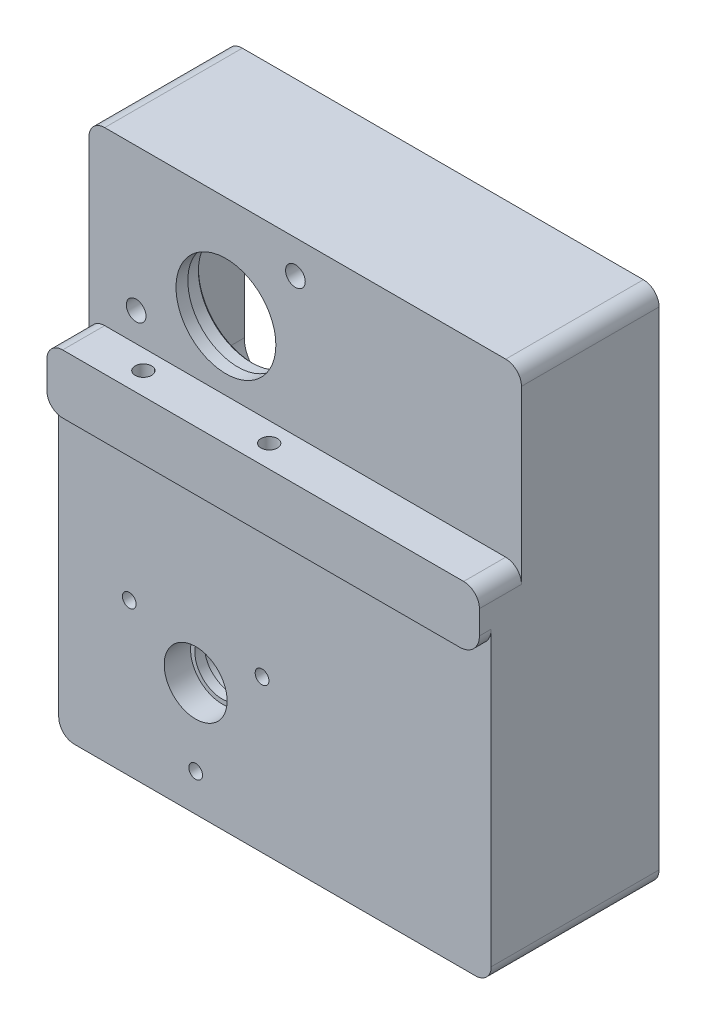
ISO-10303-21;
HEADER;
FILE_DESCRIPTION(('STEP AP214'),'2;1');
FILE_NAME('part.step','',(''),(''),'','','');
FILE_SCHEMA(('AUTOMOTIVE_DESIGN { 1 0 10303 214 1 1 1 1 }'));
ENDSEC;
DATA;
#1=APPLICATION_CONTEXT('core data for automotive mechanical design processes');
#2=APPLICATION_PROTOCOL_DEFINITION('international standard','automotive_design',2000,#1);
#3=PRODUCT_CONTEXT('',#1,'mechanical');
#4=PRODUCT('Part','Part','',(#3));
#5=PRODUCT_RELATED_PRODUCT_CATEGORY('part','',(#4));
#6=PRODUCT_DEFINITION_FORMATION('','',#4);
#7=PRODUCT_DEFINITION_CONTEXT('part definition',#1,'design');
#8=PRODUCT_DEFINITION('design','',#6,#7);
#9=PRODUCT_DEFINITION_SHAPE('','',#8);
#10=(LENGTH_UNIT() NAMED_UNIT(*) SI_UNIT(.MILLI.,.METRE.));
#11=(NAMED_UNIT(*) PLANE_ANGLE_UNIT() SI_UNIT($,.RADIAN.));
#12=(NAMED_UNIT(*) SI_UNIT($,.STERADIAN.) SOLID_ANGLE_UNIT());
#13=UNCERTAINTY_MEASURE_WITH_UNIT(LENGTH_MEASURE(1.E-05),#10,'distance_accuracy_value','');
#14=(GEOMETRIC_REPRESENTATION_CONTEXT(3) GLOBAL_UNCERTAINTY_ASSIGNED_CONTEXT((#13)) GLOBAL_UNIT_ASSIGNED_CONTEXT((#10,
#11,#12)) REPRESENTATION_CONTEXT('',''));
#15=CARTESIAN_POINT('',(0.,0.,0.));
#16=DIRECTION('',(0.,0.,1.));
#17=DIRECTION('',(1.,0.,0.));
#18=AXIS2_PLACEMENT_3D('',#15,#16,#17);
#19=CARTESIAN_POINT('',(0.,0.,-30.));
#20=DIRECTION('',(0.,0.,-1.));
#21=DIRECTION('',(-1.,0.,0.));
#22=AXIS2_PLACEMENT_3D('',#19,#20,#21);
#23=PLANE('',#22);
#24=CARTESIAN_POINT('',(-30.83,-58.,-30.));
#25=DIRECTION('',(0.,0.,-1.));
#26=DIRECTION('',(-1.,0.,0.));
#27=AXIS2_PLACEMENT_3D('',#24,#25,#26);
#28=CIRCLE('',#27,4.);
#29=CARTESIAN_POINT('',(-34.83,-58.,-30.));
#30=VERTEX_POINT('',#29);
#31=CARTESIAN_POINT('',(-30.83,-62.,-30.));
#32=VERTEX_POINT('',#31);
#33=EDGE_CURVE('E1151',#30,#32,#28,.F.);
#34=ORIENTED_EDGE('',*,*,#33,.F.);
#35=DIRECTION('',(0.,1.,0.));
#36=VECTOR('',#35,1.);
#37=CARTESIAN_POINT('',(-34.83,0.,-30.));
#38=LINE('',#37,#36);
#39=CARTESIAN_POINT('',(-34.83,66.,-30.));
#40=VERTEX_POINT('',#39);
#41=EDGE_CURVE('E1174',#30,#40,#38,.T.);
#42=ORIENTED_EDGE('',*,*,#41,.T.);
#43=CARTESIAN_POINT('',(-30.83,66.,-30.));
#44=DIRECTION('',(0.,0.,-1.));
#45=DIRECTION('',(-1.,0.,0.));
#46=AXIS2_PLACEMENT_3D('',#43,#44,#45);
#47=CIRCLE('',#46,4.);
#48=CARTESIAN_POINT('',(-30.83,70.,-30.));
#49=VERTEX_POINT('',#48);
#50=EDGE_CURVE('E1184',#40,#49,#47,.T.);
#51=ORIENTED_EDGE('',*,*,#50,.T.);
#52=DIRECTION('',(1.,0.,0.));
#53=VECTOR('',#52,1.);
#54=CARTESIAN_POINT('',(0.,70.,-30.));
#55=LINE('',#54,#53);
#56=CARTESIAN_POINT('',(71.17,70.,-30.));
#57=VERTEX_POINT('',#56);
#58=EDGE_CURVE('E859',#49,#57,#55,.T.);
#59=ORIENTED_EDGE('',*,*,#58,.T.);
#60=CARTESIAN_POINT('',(71.17,66.,-30.));
#61=DIRECTION('',(0.,0.,-1.));
#62=DIRECTION('',(-1.,0.,0.));
#63=AXIS2_PLACEMENT_3D('',#60,#61,#62);
#64=CIRCLE('',#63,4.);
#65=CARTESIAN_POINT('',(75.17,66.,-30.));
#66=VERTEX_POINT('',#65);
#67=EDGE_CURVE('E948',#57,#66,#64,.T.);
#68=ORIENTED_EDGE('',*,*,#67,.T.);
#69=DIRECTION('',(0.,-1.,0.));
#70=VECTOR('',#69,1.);
#71=CARTESIAN_POINT('',(75.17,0.,-30.));
#72=LINE('',#71,#70);
#73=CARTESIAN_POINT('',(75.17,-58.,-30.));
#74=VERTEX_POINT('',#73);
#75=EDGE_CURVE('E861',#66,#74,#72,.T.);
#76=ORIENTED_EDGE('',*,*,#75,.T.);
#77=CARTESIAN_POINT('',(71.17,-58.,-30.));
#78=DIRECTION('',(0.,0.,-1.));
#79=DIRECTION('',(-1.,0.,0.));
#80=AXIS2_PLACEMENT_3D('',#77,#78,#79);
#81=CIRCLE('',#80,4.00000000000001);
#82=CARTESIAN_POINT('',(71.17,-62.,-30.));
#83=VERTEX_POINT('',#82);
#84=EDGE_CURVE('E1143',#83,#74,#81,.F.);
#85=ORIENTED_EDGE('',*,*,#84,.F.);
#86=DIRECTION('',(1.,0.,0.));
#87=VECTOR('',#86,1.);
#88=CARTESIAN_POINT('',(-30.83,-62.,-30.));
#89=LINE('',#88,#87);
#90=EDGE_CURVE('E1147',#32,#83,#89,.T.);
#91=ORIENTED_EDGE('',*,*,#90,.F.);
#92=EDGE_LOOP('',(#34,#42,#51,#59,#68,#76,#85,#91));
#93=FACE_BOUND('',#92,.T.);
#94=CARTESIAN_POINT('',(-30.2756349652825,-51.4503437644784,-30.));
#95=DIRECTION('',(0.,0.,-1.));
#96=DIRECTION('',(-1.,0.,0.));
#97=AXIS2_PLACEMENT_3D('',#94,#95,#96);
#98=CIRCLE('',#97,1.99999999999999);
#99=CARTESIAN_POINT('',(-32.2756349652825,-51.4503437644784,-30.));
#100=VERTEX_POINT('',#99);
#101=EDGE_CURVE('E1103',#100,#100,#98,.T.);
#102=ORIENTED_EDGE('',*,*,#101,.F.);
#103=EDGE_LOOP('',(#102));
#104=FACE_BOUND('',#103,.T.);
#105=CARTESIAN_POINT('',(70.67,59.5,-30.));
#106=DIRECTION('',(0.,0.,-1.));
#107=DIRECTION('',(-1.,0.,0.));
#108=AXIS2_PLACEMENT_3D('',#105,#106,#107);
#109=CIRCLE('',#108,1.99999999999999);
#110=CARTESIAN_POINT('',(68.67,59.5,-30.));
#111=VERTEX_POINT('',#110);
#112=EDGE_CURVE('E1097',#111,#111,#109,.T.);
#113=ORIENTED_EDGE('',*,*,#112,.F.);
#114=EDGE_LOOP('',(#113));
#115=FACE_BOUND('',#114,.T.);
#116=CARTESIAN_POINT('',(-30.3203503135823,-6.09889118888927,-30.));
#117=DIRECTION('',(0.,0.,-1.));
#118=DIRECTION('',(-1.,0.,0.));
#119=AXIS2_PLACEMENT_3D('',#116,#117,#118);
#120=CIRCLE('',#119,2.09999999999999);
#121=CARTESIAN_POINT('',(-32.4203503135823,-6.09889118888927,-30.));
#122=VERTEX_POINT('',#121);
#123=EDGE_CURVE('E1091',#122,#122,#120,.T.);
#124=ORIENTED_EDGE('',*,*,#123,.F.);
#125=EDGE_LOOP('',(#124));
#126=FACE_BOUND('',#125,.T.);
#127=CARTESIAN_POINT('',(70.6796496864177,-6.09889118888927,-30.));
#128=DIRECTION('',(0.,0.,-1.));
#129=DIRECTION('',(-1.,0.,0.));
#130=AXIS2_PLACEMENT_3D('',#127,#128,#129);
#131=CIRCLE('',#130,2.09999999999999);
#132=CARTESIAN_POINT('',(68.5796496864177,-6.09889118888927,-30.));
#133=VERTEX_POINT('',#132);
#134=EDGE_CURVE('E1085',#133,#133,#131,.T.);
#135=ORIENTED_EDGE('',*,*,#134,.F.);
#136=EDGE_LOOP('',(#135));
#137=FACE_BOUND('',#136,.T.);
#138=CARTESIAN_POINT('',(70.6796496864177,-57.5988911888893,-30.));
#139=DIRECTION('',(0.,0.,-1.));
#140=DIRECTION('',(-1.,0.,0.));
#141=AXIS2_PLACEMENT_3D('',#138,#139,#140);
#142=CIRCLE('',#141,2.09999999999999);
#143=CARTESIAN_POINT('',(68.5796496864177,-57.5988911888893,-30.));
#144=VERTEX_POINT('',#143);
#145=EDGE_CURVE('E1079',#144,#144,#142,.T.);
#146=ORIENTED_EDGE('',*,*,#145,.F.);
#147=EDGE_LOOP('',(#146));
#148=FACE_BOUND('',#147,.T.);
#149=CARTESIAN_POINT('',(-30.3203503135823,-57.5988911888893,-30.));
#150=DIRECTION('',(0.,0.,-1.));
#151=DIRECTION('',(-1.,0.,0.));
#152=AXIS2_PLACEMENT_3D('',#149,#150,#151);
#153=CIRCLE('',#152,2.09999999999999);
#154=CARTESIAN_POINT('',(-32.4203503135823,-57.5988911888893,-30.));
#155=VERTEX_POINT('',#154);
#156=EDGE_CURVE('E1073',#155,#155,#153,.T.);
#157=ORIENTED_EDGE('',*,*,#156,.F.);
#158=EDGE_LOOP('',(#157));
#159=FACE_BOUND('',#158,.T.);
#160=CARTESIAN_POINT('',(-30.3203503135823,65.4011088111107,-30.));
#161=DIRECTION('',(0.,0.,-1.));
#162=DIRECTION('',(-1.,0.,0.));
#163=AXIS2_PLACEMENT_3D('',#160,#161,#162);
#164=CIRCLE('',#163,2.09999999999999);
#165=CARTESIAN_POINT('',(-32.4203503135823,65.4011088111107,-30.));
#166=VERTEX_POINT('',#165);
#167=EDGE_CURVE('E1067',#166,#166,#164,.T.);
#168=ORIENTED_EDGE('',*,*,#167,.F.);
#169=EDGE_LOOP('',(#168));
#170=FACE_BOUND('',#169,.T.);
#171=CARTESIAN_POINT('',(70.6796496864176,65.4011088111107,-30.));
#172=DIRECTION('',(0.,0.,-1.));
#173=DIRECTION('',(-1.,0.,0.));
#174=AXIS2_PLACEMENT_3D('',#171,#172,#173);
#175=CIRCLE('',#174,2.09999999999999);
#176=CARTESIAN_POINT('',(68.5796496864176,65.4011088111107,-30.));
#177=VERTEX_POINT('',#176);
#178=EDGE_CURVE('E1058',#177,#177,#175,.T.);
#179=ORIENTED_EDGE('',*,*,#178,.F.);
#180=EDGE_LOOP('',(#179));
#181=FACE_BOUND('',#180,.T.);
#182=DIRECTION('',(1.,0.,0.));
#183=VECTOR('',#182,1.);
#184=CARTESIAN_POINT('',(-5.32999999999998,-60.75,-30.));
#185=LINE('',#184,#183);
#186=CARTESIAN_POINT('',(-5.32999999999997,-60.75,-30.));
#187=VERTEX_POINT('',#186);
#188=CARTESIAN_POINT('',(45.67,-60.75,-30.));
#189=VERTEX_POINT('',#188);
#190=EDGE_CURVE('E608',#187,#189,#185,.T.);
#191=ORIENTED_EDGE('',*,*,#190,.T.);
#192=CARTESIAN_POINT('',(45.67,-32.5,-30.));
#193=DIRECTION('',(0.,0.,-1.));
#194=DIRECTION('',(-1.,0.,0.));
#195=AXIS2_PLACEMENT_3D('',#192,#193,#194);
#196=CIRCLE('',#195,28.25);
#197=CARTESIAN_POINT('',(73.92,-32.5,-30.));
#198=VERTEX_POINT('',#197);
#199=EDGE_CURVE('E611',#189,#198,#196,.F.);
#200=ORIENTED_EDGE('',*,*,#199,.T.);
#201=DIRECTION('',(0.,-1.,0.));
#202=VECTOR('',#201,1.);
#203=CARTESIAN_POINT('',(73.92,-18.6593976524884,-30.));
#204=LINE('',#203,#202);
#205=CARTESIAN_POINT('',(73.92,-18.6593976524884,-30.));
#206=VERTEX_POINT('',#205);
#207=EDGE_CURVE('E569',#206,#198,#204,.T.);
#208=ORIENTED_EDGE('',*,*,#207,.F.);
#209=CARTESIAN_POINT('',(62.92,-18.6593976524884,-30.));
#210=DIRECTION('',(0.,0.,-1.));
#211=DIRECTION('',(-1.,0.,0.));
#212=AXIS2_PLACEMENT_3D('',#209,#210,#211);
#213=CIRCLE('',#212,11.);
#214=CARTESIAN_POINT('',(68.6996610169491,-9.30014989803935,-30.));
#215=VERTEX_POINT('',#214);
#216=EDGE_CURVE('E519',#206,#215,#213,.F.);
#217=ORIENTED_EDGE('',*,*,#216,.T.);
#218=CARTESIAN_POINT('',(70.67,-6.1094972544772,-30.));
#219=DIRECTION('',(0.,0.,1.));
#220=DIRECTION('',(1.,0.,0.));
#221=AXIS2_PLACEMENT_3D('',#218,#219,#220);
#222=CIRCLE('',#221,3.75);
#223=CARTESIAN_POINT('',(68.6996610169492,-2.91884461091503,-30.));
#224=VERTEX_POINT('',#223);
#225=EDGE_CURVE('E572',#215,#224,#222,.F.);
#226=ORIENTED_EDGE('',*,*,#225,.T.);
#227=CARTESIAN_POINT('',(62.92,6.44040314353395,-30.));
#228=DIRECTION('',(0.,0.,-1.));
#229=DIRECTION('',(-1.,0.,0.));
#230=AXIS2_PLACEMENT_3D('',#227,#228,#229);
#231=CIRCLE('',#230,11.);
#232=CARTESIAN_POINT('',(73.92,6.44040314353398,-30.));
#233=VERTEX_POINT('',#232);
#234=EDGE_CURVE('E575',#224,#233,#231,.F.);
#235=ORIENTED_EDGE('',*,*,#234,.T.);
#236=DIRECTION('',(0.,1.,0.));
#237=VECTOR('',#236,1.);
#238=CARTESIAN_POINT('',(73.92,6.44040314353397,-30.));
#239=LINE('',#238,#237);
#240=CARTESIAN_POINT('',(73.92,40.5,-30.));
#241=VERTEX_POINT('',#240);
#242=EDGE_CURVE('E578',#233,#241,#239,.T.);
#243=ORIENTED_EDGE('',*,*,#242,.T.);
#244=CARTESIAN_POINT('',(45.67,40.5,-30.));
#245=DIRECTION('',(0.,0.,-1.));
#246=DIRECTION('',(-1.,0.,0.));
#247=AXIS2_PLACEMENT_3D('',#244,#245,#246);
#248=CIRCLE('',#247,28.25);
#249=CARTESIAN_POINT('',(45.67,68.75,-30.));
#250=VERTEX_POINT('',#249);
#251=EDGE_CURVE('E581',#241,#250,#248,.F.);
#252=ORIENTED_EDGE('',*,*,#251,.T.);
#253=DIRECTION('',(-1.,0.,0.));
#254=VECTOR('',#253,1.);
#255=CARTESIAN_POINT('',(45.67,68.75,-30.));
#256=LINE('',#255,#254);
#257=CARTESIAN_POINT('',(-5.33000000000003,68.75,-30.));
#258=VERTEX_POINT('',#257);
#259=EDGE_CURVE('E584',#250,#258,#256,.T.);
#260=ORIENTED_EDGE('',*,*,#259,.T.);
#261=CARTESIAN_POINT('',(-5.33,40.5,-30.));
#262=DIRECTION('',(0.,0.,-1.));
#263=DIRECTION('',(-1.,0.,0.));
#264=AXIS2_PLACEMENT_3D('',#261,#262,#263);
#265=CIRCLE('',#264,28.25);
#266=CARTESIAN_POINT('',(-33.58,40.5,-30.));
#267=VERTEX_POINT('',#266);
#268=EDGE_CURVE('E587',#258,#267,#265,.F.);
#269=ORIENTED_EDGE('',*,*,#268,.T.);
#270=DIRECTION('',(0.,-1.,0.));
#271=VECTOR('',#270,1.);
#272=CARTESIAN_POINT('',(-33.58,40.5,-30.));
#273=LINE('',#272,#271);
#274=CARTESIAN_POINT('',(-33.58,6.44040314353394,-30.));
#275=VERTEX_POINT('',#274);
#276=EDGE_CURVE('E590',#267,#275,#273,.T.);
#277=ORIENTED_EDGE('',*,*,#276,.T.);
#278=CARTESIAN_POINT('',(-22.58,6.44040314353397,-30.));
#279=DIRECTION('',(0.,0.,-1.));
#280=DIRECTION('',(-1.,0.,0.));
#281=AXIS2_PLACEMENT_3D('',#278,#279,#280);
#282=CIRCLE('',#281,11.);
#283=CARTESIAN_POINT('',(-28.3596610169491,-2.91884461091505,-30.));
#284=VERTEX_POINT('',#283);
#285=EDGE_CURVE('E593',#275,#284,#282,.F.);
#286=ORIENTED_EDGE('',*,*,#285,.T.);
#287=CARTESIAN_POINT('',(-30.33,-6.10949725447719,-30.));
#288=DIRECTION('',(0.,0.,1.));
#289=DIRECTION('',(1.,0.,0.));
#290=AXIS2_PLACEMENT_3D('',#287,#288,#289);
#291=CIRCLE('',#290,3.75);
#292=CARTESIAN_POINT('',(-28.3596610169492,-9.30014989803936,-30.));
#293=VERTEX_POINT('',#292);
#294=EDGE_CURVE('E596',#284,#293,#291,.F.);
#295=ORIENTED_EDGE('',*,*,#294,.T.);
#296=CARTESIAN_POINT('',(-22.58,-18.6593976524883,-30.));
#297=DIRECTION('',(0.,0.,-1.));
#298=DIRECTION('',(-1.,0.,0.));
#299=AXIS2_PLACEMENT_3D('',#296,#297,#298);
#300=CIRCLE('',#299,11.);
#301=CARTESIAN_POINT('',(-33.58,-18.6593976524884,-30.));
#302=VERTEX_POINT('',#301);
#303=EDGE_CURVE('E599',#293,#302,#300,.F.);
#304=ORIENTED_EDGE('',*,*,#303,.T.);
#305=DIRECTION('',(0.,-1.,0.));
#306=VECTOR('',#305,1.);
#307=CARTESIAN_POINT('',(-33.58,-18.6593976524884,-30.));
#308=LINE('',#307,#306);
#309=CARTESIAN_POINT('',(-33.58,-32.5,-30.));
#310=VERTEX_POINT('',#309);
#311=EDGE_CURVE('E602',#302,#310,#308,.T.);
#312=ORIENTED_EDGE('',*,*,#311,.T.);
#313=CARTESIAN_POINT('',(-5.33,-32.5,-30.));
#314=DIRECTION('',(0.,0.,-1.));
#315=DIRECTION('',(-1.,0.,0.));
#316=AXIS2_PLACEMENT_3D('',#313,#314,#315);
#317=CIRCLE('',#316,28.25);
#318=EDGE_CURVE('E605',#310,#187,#317,.F.);
#319=ORIENTED_EDGE('',*,*,#318,.T.);
#320=EDGE_LOOP('',(#191,#200,#208,#217,#226,#235,#243,#252,#260,#269,#277,#286,#295,#304,#312,#319));
#321=FACE_BOUND('',#320,.T.);
#322=ADVANCED_FACE('F150',(#93,#104,#115,#126,#137,#148,#159,#170,#181,#321),#23,.T.);
#323=DIRECTION('',(0.,-1.,0.));
#324=VECTOR('',#323,1.);
#325=CARTESIAN_POINT('',(-30.33,0.,-30.));
#326=LINE('',#325,#324);
#327=CARTESIAN_POINT('',(-30.33,40.5,-30.));
#328=VERTEX_POINT('',#327);
#329=CARTESIAN_POINT('',(-30.33,6.44040314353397,-30.));
#330=VERTEX_POINT('',#329);
#331=EDGE_CURVE('E1178',#328,#330,#326,.T.);
#332=ORIENTED_EDGE('',*,*,#331,.T.);
#333=CARTESIAN_POINT('',(-22.58,6.44040314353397,-30.));
#334=DIRECTION('',(0.,0.,1.));
#335=DIRECTION('',(1.,0.,0.));
#336=AXIS2_PLACEMENT_3D('',#333,#334,#335);
#337=CIRCLE('',#336,7.75);
#338=CARTESIAN_POINT('',(-26.6520338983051,-0.153612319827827,-30.));
#339=VERTEX_POINT('',#338);
#340=EDGE_CURVE('E2271',#330,#339,#337,.T.);
#341=ORIENTED_EDGE('',*,*,#340,.T.);
#342=CARTESIAN_POINT('',(-30.33,-6.10949725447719,-30.));
#343=DIRECTION('',(0.,0.,-1.));
#344=DIRECTION('',(1.,0.,0.));
#345=AXIS2_PLACEMENT_3D('',#342,#343,#344);
#346=CIRCLE('',#345,7.);
#347=CARTESIAN_POINT('',(-26.6520338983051,-12.0653821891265,-30.));
#348=VERTEX_POINT('',#347);
#349=EDGE_CURVE('E2274',#339,#348,#346,.T.);
#350=ORIENTED_EDGE('',*,*,#349,.T.);
#351=CARTESIAN_POINT('',(-22.58,-18.6593976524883,-30.));
#352=DIRECTION('',(0.,0.,1.));
#353=DIRECTION('',(1.,0.,0.));
#354=AXIS2_PLACEMENT_3D('',#351,#352,#353);
#355=CIRCLE('',#354,7.75);
#356=CARTESIAN_POINT('',(-30.33,-18.6593976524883,-30.));
#357=VERTEX_POINT('',#356);
#358=EDGE_CURVE('E1034',#348,#357,#355,.T.);
#359=ORIENTED_EDGE('',*,*,#358,.T.);
#360=DIRECTION('',(0.,1.,0.));
#361=VECTOR('',#360,1.);
#362=CARTESIAN_POINT('',(-30.33,-32.5,-30.));
#363=LINE('',#362,#361);
#364=CARTESIAN_POINT('',(-30.33,-32.5,-30.));
#365=VERTEX_POINT('',#364);
#366=EDGE_CURVE('E1155',#365,#357,#363,.T.);
#367=ORIENTED_EDGE('',*,*,#366,.F.);
#368=CARTESIAN_POINT('',(-5.33,-32.5,-30.));
#369=DIRECTION('',(0.,0.,-1.));
#370=DIRECTION('',(-1.,0.,0.));
#371=AXIS2_PLACEMENT_3D('',#368,#369,#370);
#372=CIRCLE('',#371,25.);
#373=CARTESIAN_POINT('',(-5.33000000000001,-57.5,-30.));
#374=VERTEX_POINT('',#373);
#375=EDGE_CURVE('E1159',#374,#365,#372,.T.);
#376=ORIENTED_EDGE('',*,*,#375,.F.);
#377=DIRECTION('',(-1.,0.,0.));
#378=VECTOR('',#377,1.);
#379=CARTESIAN_POINT('',(45.67,-57.5,-30.));
#380=LINE('',#379,#378);
#381=CARTESIAN_POINT('',(45.67,-57.5,-30.));
#382=VERTEX_POINT('',#381);
#383=EDGE_CURVE('E1127',#382,#374,#380,.T.);
#384=ORIENTED_EDGE('',*,*,#383,.F.);
#385=CARTESIAN_POINT('',(45.67,-32.5,-30.));
#386=DIRECTION('',(0.,0.,-1.));
#387=DIRECTION('',(-1.,0.,0.));
#388=AXIS2_PLACEMENT_3D('',#385,#386,#387);
#389=CIRCLE('',#388,25.);
#390=CARTESIAN_POINT('',(70.67,-32.5,-30.));
#391=VERTEX_POINT('',#390);
#392=EDGE_CURVE('E1138',#391,#382,#389,.T.);
#393=ORIENTED_EDGE('',*,*,#392,.F.);
#394=DIRECTION('',(0.,1.,0.));
#395=VECTOR('',#394,1.);
#396=CARTESIAN_POINT('',(70.67,0.,-30.));
#397=LINE('',#396,#395);
#398=CARTESIAN_POINT('',(70.67,-18.6593976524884,-30.));
#399=VERTEX_POINT('',#398);
#400=EDGE_CURVE('E864',#391,#399,#397,.T.);
#401=ORIENTED_EDGE('',*,*,#400,.T.);
#402=CARTESIAN_POINT('',(62.92,-18.6593976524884,-30.));
#403=DIRECTION('',(0.,0.,1.));
#404=DIRECTION('',(-1.,0.,0.));
#405=AXIS2_PLACEMENT_3D('',#402,#403,#404);
#406=CIRCLE('',#405,7.75000000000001);
#407=CARTESIAN_POINT('',(66.9920338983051,-12.0653821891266,-30.));
#408=VERTEX_POINT('',#407);
#409=EDGE_CURVE('E1030',#399,#408,#406,.T.);
#410=ORIENTED_EDGE('',*,*,#409,.T.);
#411=CARTESIAN_POINT('',(70.67,-6.1094972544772,-30.));
#412=DIRECTION('',(0.,0.,-1.));
#413=DIRECTION('',(-1.,0.,0.));
#414=AXIS2_PLACEMENT_3D('',#411,#412,#413);
#415=CIRCLE('',#414,7.00000000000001);
#416=CARTESIAN_POINT('',(66.9920338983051,-0.153612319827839,-30.));
#417=VERTEX_POINT('',#416);
#418=EDGE_CURVE('E1039',#408,#417,#415,.T.);
#419=ORIENTED_EDGE('',*,*,#418,.T.);
#420=CARTESIAN_POINT('',(62.92,6.44040314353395,-30.));
#421=DIRECTION('',(0.,0.,1.));
#422=DIRECTION('',(-1.,0.,0.));
#423=AXIS2_PLACEMENT_3D('',#420,#421,#422);
#424=CIRCLE('',#423,7.75);
#425=CARTESIAN_POINT('',(70.67,6.44040314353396,-30.));
#426=VERTEX_POINT('',#425);
#427=EDGE_CURVE('E1035',#417,#426,#424,.T.);
#428=ORIENTED_EDGE('',*,*,#427,.T.);
#429=CARTESIAN_POINT('',(70.67,40.5,-30.));
#430=VERTEX_POINT('',#429);
#431=EDGE_CURVE('E863',#426,#430,#397,.T.);
#432=ORIENTED_EDGE('',*,*,#431,.T.);
#433=CARTESIAN_POINT('',(45.67,40.5,-30.));
#434=DIRECTION('',(0.,0.,-1.));
#435=DIRECTION('',(-1.,0.,0.));
#436=AXIS2_PLACEMENT_3D('',#433,#434,#435);
#437=CIRCLE('',#436,25.);
#438=CARTESIAN_POINT('',(45.67,65.5,-30.));
#439=VERTEX_POINT('',#438);
#440=EDGE_CURVE('E935',#430,#439,#437,.F.);
#441=ORIENTED_EDGE('',*,*,#440,.T.);
#442=DIRECTION('',(1.,0.,0.));
#443=VECTOR('',#442,1.);
#444=CARTESIAN_POINT('',(0.,65.5,-30.));
#445=LINE('',#444,#443);
#446=CARTESIAN_POINT('',(-5.33,65.5,-30.));
#447=VERTEX_POINT('',#446);
#448=EDGE_CURVE('E867',#447,#439,#445,.T.);
#449=ORIENTED_EDGE('',*,*,#448,.F.);
#450=CARTESIAN_POINT('',(-5.33,40.5,-30.));
#451=DIRECTION('',(0.,0.,-1.));
#452=DIRECTION('',(-1.,0.,0.));
#453=AXIS2_PLACEMENT_3D('',#450,#451,#452);
#454=CIRCLE('',#453,25.);
#455=EDGE_CURVE('E1187',#328,#447,#454,.T.);
#456=ORIENTED_EDGE('',*,*,#455,.F.);
#457=EDGE_LOOP('',(#332,#341,#350,#359,#367,#376,#384,#393,#401,#410,#419,#428,#432,#441,#449,#456));
#458=FACE_BOUND('',#457,.T.);
#459=DIRECTION('',(0.,-1.,0.));
#460=VECTOR('',#459,1.);
#461=CARTESIAN_POINT('',(71.92,-18.6593976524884,-30.));
#462=LINE('',#461,#460);
#463=CARTESIAN_POINT('',(71.92,-32.5,-30.));
#464=VERTEX_POINT('',#463);
#465=CARTESIAN_POINT('',(71.92,-18.6593976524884,-30.));
#466=VERTEX_POINT('',#465);
#467=EDGE_CURVE('E506',#464,#466,#462,.F.);
#468=ORIENTED_EDGE('',*,*,#467,.F.);
#469=CARTESIAN_POINT('',(45.67,-32.5,-30.));
#470=DIRECTION('',(0.,0.,1.));
#471=DIRECTION('',(1.,0.,0.));
#472=AXIS2_PLACEMENT_3D('',#469,#470,#471);
#473=CIRCLE('',#472,26.25);
#474=CARTESIAN_POINT('',(45.67,-58.75,-30.));
#475=VERTEX_POINT('',#474);
#476=EDGE_CURVE('E567',#464,#475,#473,.F.);
#477=ORIENTED_EDGE('',*,*,#476,.T.);
#478=DIRECTION('',(1.,0.,0.));
#479=VECTOR('',#478,1.);
#480=CARTESIAN_POINT('',(-5.32999999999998,-58.75,-30.));
#481=LINE('',#480,#479);
#482=CARTESIAN_POINT('',(-5.32999999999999,-58.75,-30.));
#483=VERTEX_POINT('',#482);
#484=EDGE_CURVE('E564',#475,#483,#481,.F.);
#485=ORIENTED_EDGE('',*,*,#484,.T.);
#486=CARTESIAN_POINT('',(-5.33,-32.5,-30.));
#487=DIRECTION('',(0.,0.,1.));
#488=DIRECTION('',(1.,0.,0.));
#489=AXIS2_PLACEMENT_3D('',#486,#487,#488);
#490=CIRCLE('',#489,26.25);
#491=CARTESIAN_POINT('',(-31.58,-32.5,-30.));
#492=VERTEX_POINT('',#491);
#493=EDGE_CURVE('E561',#483,#492,#490,.F.);
#494=ORIENTED_EDGE('',*,*,#493,.T.);
#495=DIRECTION('',(0.,-1.,0.));
#496=VECTOR('',#495,1.);
#497=CARTESIAN_POINT('',(-31.58,-18.6593976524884,-30.));
#498=LINE('',#497,#496);
#499=CARTESIAN_POINT('',(-31.58,-18.6593976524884,-30.));
#500=VERTEX_POINT('',#499);
#501=EDGE_CURVE('E558',#492,#500,#498,.F.);
#502=ORIENTED_EDGE('',*,*,#501,.T.);
#503=CARTESIAN_POINT('',(-22.58,-18.6593976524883,-30.));
#504=DIRECTION('',(0.,0.,1.));
#505=DIRECTION('',(1.,0.,0.));
#506=AXIS2_PLACEMENT_3D('',#503,#504,#505);
#507=CIRCLE('',#506,8.99999999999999);
#508=CARTESIAN_POINT('',(-27.308813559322,-11.0018313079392,-30.));
#509=VERTEX_POINT('',#508);
#510=EDGE_CURVE('E555',#500,#509,#507,.F.);
#511=ORIENTED_EDGE('',*,*,#510,.T.);
#512=CARTESIAN_POINT('',(-30.33,-6.10949725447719,-30.));
#513=DIRECTION('',(0.,0.,-1.));
#514=DIRECTION('',(-1.,0.,0.));
#515=AXIS2_PLACEMENT_3D('',#512,#513,#514);
#516=CIRCLE('',#515,5.75);
#517=CARTESIAN_POINT('',(-27.308813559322,-1.21716320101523,-30.));
#518=VERTEX_POINT('',#517);
#519=EDGE_CURVE('E552',#509,#518,#516,.F.);
#520=ORIENTED_EDGE('',*,*,#519,.T.);
#521=CARTESIAN_POINT('',(-22.58,6.44040314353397,-30.));
#522=DIRECTION('',(0.,0.,1.));
#523=DIRECTION('',(1.,0.,0.));
#524=AXIS2_PLACEMENT_3D('',#521,#522,#523);
#525=CIRCLE('',#524,9.00000000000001);
#526=CARTESIAN_POINT('',(-31.58,6.44040314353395,-30.));
#527=VERTEX_POINT('',#526);
#528=EDGE_CURVE('E549',#518,#527,#525,.F.);
#529=ORIENTED_EDGE('',*,*,#528,.T.);
#530=DIRECTION('',(0.,-1.,0.));
#531=VECTOR('',#530,1.);
#532=CARTESIAN_POINT('',(-31.58,40.5,-30.));
#533=LINE('',#532,#531);
#534=CARTESIAN_POINT('',(-31.58,40.5,-30.));
#535=VERTEX_POINT('',#534);
#536=EDGE_CURVE('E546',#527,#535,#533,.F.);
#537=ORIENTED_EDGE('',*,*,#536,.T.);
#538=CARTESIAN_POINT('',(-5.33,40.5,-30.));
#539=DIRECTION('',(0.,0.,1.));
#540=DIRECTION('',(1.,0.,0.));
#541=AXIS2_PLACEMENT_3D('',#538,#539,#540);
#542=CIRCLE('',#541,26.25);
#543=CARTESIAN_POINT('',(-5.33000000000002,66.75,-30.));
#544=VERTEX_POINT('',#543);
#545=EDGE_CURVE('E543',#535,#544,#542,.F.);
#546=ORIENTED_EDGE('',*,*,#545,.T.);
#547=DIRECTION('',(-1.,0.,0.));
#548=VECTOR('',#547,1.);
#549=CARTESIAN_POINT('',(45.67,66.75,-30.));
#550=LINE('',#549,#548);
#551=CARTESIAN_POINT('',(45.67,66.75,-30.));
#552=VERTEX_POINT('',#551);
#553=EDGE_CURVE('E540',#544,#552,#550,.F.);
#554=ORIENTED_EDGE('',*,*,#553,.T.);
#555=CARTESIAN_POINT('',(45.67,40.5,-30.));
#556=DIRECTION('',(0.,0.,1.));
#557=DIRECTION('',(1.,0.,0.));
#558=AXIS2_PLACEMENT_3D('',#555,#556,#557);
#559=CIRCLE('',#558,26.25);
#560=CARTESIAN_POINT('',(71.92,40.5,-30.));
#561=VERTEX_POINT('',#560);
#562=EDGE_CURVE('E537',#552,#561,#559,.F.);
#563=ORIENTED_EDGE('',*,*,#562,.T.);
#564=DIRECTION('',(0.,1.,0.));
#565=VECTOR('',#564,1.);
#566=CARTESIAN_POINT('',(71.92,6.44040314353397,-30.));
#567=LINE('',#566,#565);
#568=CARTESIAN_POINT('',(71.92,6.44040314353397,-30.));
#569=VERTEX_POINT('',#568);
#570=EDGE_CURVE('E534',#561,#569,#567,.F.);
#571=ORIENTED_EDGE('',*,*,#570,.T.);
#572=CARTESIAN_POINT('',(62.92,6.44040314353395,-30.));
#573=DIRECTION('',(0.,0.,1.));
#574=DIRECTION('',(1.,0.,0.));
#575=AXIS2_PLACEMENT_3D('',#572,#573,#574);
#576=CIRCLE('',#575,9.00000000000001);
#577=CARTESIAN_POINT('',(67.648813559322,-1.21716320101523,-30.));
#578=VERTEX_POINT('',#577);
#579=EDGE_CURVE('E529',#569,#578,#576,.F.);
#580=ORIENTED_EDGE('',*,*,#579,.T.);
#581=CARTESIAN_POINT('',(70.67,-6.1094972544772,-30.));
#582=DIRECTION('',(0.,0.,-1.));
#583=DIRECTION('',(-1.,0.,0.));
#584=AXIS2_PLACEMENT_3D('',#581,#582,#583);
#585=CIRCLE('',#584,5.75);
#586=CARTESIAN_POINT('',(67.648813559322,-11.0018313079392,-30.));
#587=VERTEX_POINT('',#586);
#588=EDGE_CURVE('E527',#578,#587,#585,.F.);
#589=ORIENTED_EDGE('',*,*,#588,.T.);
#590=CARTESIAN_POINT('',(62.92,-18.6593976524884,-30.));
#591=DIRECTION('',(0.,0.,1.));
#592=DIRECTION('',(1.,0.,0.));
#593=AXIS2_PLACEMENT_3D('',#590,#591,#592);
#594=CIRCLE('',#593,9.00000000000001);
#595=EDGE_CURVE('E511',#587,#466,#594,.F.);
#596=ORIENTED_EDGE('',*,*,#595,.T.);
#597=EDGE_LOOP('',(#468,#477,#485,#494,#502,#511,#520,#529,#537,#546,#554,#563,#571,#580,#589,#596));
#598=FACE_BOUND('',#597,.T.);
#599=ADVANCED_FACE('F525',(#458,#598),#23,.T.);
#600=CARTESIAN_POINT('',(-30.33,-32.5,-157.25005638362));
#601=DIRECTION('',(1.,0.,0.));
#602=DIRECTION('',(0.,1.,0.));
#603=AXIS2_PLACEMENT_3D('',#600,#601,#602);
#604=PLANE('',#603);
#605=ORIENTED_EDGE('',*,*,#366,.T.);
#606=DIRECTION('',(0.,0.,-1.));
#607=VECTOR('',#606,1.);
#608=CARTESIAN_POINT('',(-30.33,-18.6593976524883,32.5576284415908));
#609=LINE('',#608,#607);
#610=CARTESIAN_POINT('',(-30.33,-18.6593976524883,6.5));
#611=VERTEX_POINT('',#610);
#612=EDGE_CURVE('E1029',#611,#357,#609,.T.);
#613=ORIENTED_EDGE('',*,*,#612,.F.);
#614=DIRECTION('',(0.,1.,0.));
#615=VECTOR('',#614,1.);
#616=CARTESIAN_POINT('',(-30.33,0.,6.5));
#617=LINE('',#616,#615);
#618=CARTESIAN_POINT('',(-30.33,-32.5,6.50000000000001));
#619=VERTEX_POINT('',#618);
#620=EDGE_CURVE('E1206',#619,#611,#617,.T.);
#621=ORIENTED_EDGE('',*,*,#620,.F.);
#622=DIRECTION('',(0.,0.,1.));
#623=VECTOR('',#622,1.);
#624=CARTESIAN_POINT('',(-30.33,-32.5,-157.25005638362));
#625=LINE('',#624,#623);
#626=EDGE_CURVE('E1158',#365,#619,#625,.T.);
#627=ORIENTED_EDGE('',*,*,#626,.F.);
#628=EDGE_LOOP('',(#605,#613,#621,#627));
#629=FACE_BOUND('',#628,.T.);
#630=ADVANCED_FACE('F664',(#629),#604,.T.);
#631=CARTESIAN_POINT('',(70.67,0.,-148.20182488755));
#632=DIRECTION('',(-1.,0.,0.));
#633=DIRECTION('',(0.,-1.,0.));
#634=AXIS2_PLACEMENT_3D('',#631,#632,#633);
#635=PLANE('',#634);
#636=ORIENTED_EDGE('',*,*,#431,.F.);
#637=DIRECTION('',(0.,0.,-1.));
#638=VECTOR('',#637,1.);
#639=CARTESIAN_POINT('',(70.67,6.44040314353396,32.5576284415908));
#640=LINE('',#639,#638);
#641=CARTESIAN_POINT('',(70.67,6.44040314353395,6.5));
#642=VERTEX_POINT('',#641);
#643=EDGE_CURVE('E1047',#642,#426,#640,.T.);
#644=ORIENTED_EDGE('',*,*,#643,.F.);
#645=DIRECTION('',(0.,-1.,0.));
#646=VECTOR('',#645,1.);
#647=CARTESIAN_POINT('',(70.67,0.,6.5));
#648=LINE('',#647,#646);
#649=CARTESIAN_POINT('',(70.67,6.97000000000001,6.5));
#650=VERTEX_POINT('',#649);
#651=EDGE_CURVE('E870',#650,#642,#648,.T.);
#652=ORIENTED_EDGE('',*,*,#651,.F.);
#653=DIRECTION('',(0.,0.,1.));
#654=VECTOR('',#653,1.);
#655=CARTESIAN_POINT('',(70.67,6.97000000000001,-148.20182488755));
#656=LINE('',#655,#654);
#657=CARTESIAN_POINT('',(70.67,6.97000000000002,-2.));
#658=VERTEX_POINT('',#657);
#659=EDGE_CURVE('E967',#650,#658,#656,.F.);
#660=ORIENTED_EDGE('',*,*,#659,.T.);
#661=DIRECTION('',(0.,-1.,0.));
#662=VECTOR('',#661,1.);
#663=CARTESIAN_POINT('',(70.67,40.5,-2.));
#664=LINE('',#663,#662);
#665=CARTESIAN_POINT('',(70.67,40.5,-2.));
#666=VERTEX_POINT('',#665);
#667=EDGE_CURVE('E827',#666,#658,#664,.T.);
#668=ORIENTED_EDGE('',*,*,#667,.F.);
#669=DIRECTION('',(0.,0.,1.));
#670=VECTOR('',#669,1.);
#671=CARTESIAN_POINT('',(70.67,40.5,-30.));
#672=LINE('',#671,#670);
#673=EDGE_CURVE('E932',#666,#430,#672,.F.);
#674=ORIENTED_EDGE('',*,*,#673,.T.);
#675=EDGE_LOOP('',(#636,#644,#652,#660,#668,#674));
#676=FACE_BOUND('',#675,.T.);
#677=ADVANCED_FACE('F684',(#676),#635,.T.);
#678=CARTESIAN_POINT('',(0.,0.,12.7));
#679=DIRECTION('',(0.,0.,1.));
#680=DIRECTION('',(1.,0.,0.));
#681=AXIS2_PLACEMENT_3D('',#678,#679,#680);
#682=PLANE('',#681);
#683=CARTESIAN_POINT('',(0.,-52.53,12.7));
#684=DIRECTION('',(0.,0.,1.));
#685=DIRECTION('',(1.,0.,0.));
#686=AXIS2_PLACEMENT_3D('',#683,#684,#685);
#687=CIRCLE('',#686,1.75);
#688=CARTESIAN_POINT('',(1.75,-52.53,12.7));
#689=VERTEX_POINT('',#688);
#690=EDGE_CURVE('E881',#689,#689,#687,.T.);
#691=ORIENTED_EDGE('',*,*,#690,.F.);
#692=EDGE_LOOP('',(#691));
#693=FACE_BOUND('',#692,.T.);
#694=CARTESIAN_POINT('',(-16.8874953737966,-23.28,12.7));
#695=DIRECTION('',(0.,0.,1.));
#696=DIRECTION('',(1.,0.,0.));
#697=AXIS2_PLACEMENT_3D('',#694,#695,#696);
#698=CIRCLE('',#697,1.75);
#699=CARTESIAN_POINT('',(-15.1374953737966,-23.28,12.7));
#700=VERTEX_POINT('',#699);
#701=EDGE_CURVE('E884',#700,#700,#698,.T.);
#702=ORIENTED_EDGE('',*,*,#701,.F.);
#703=EDGE_LOOP('',(#702));
#704=FACE_BOUND('',#703,.T.);
#705=CARTESIAN_POINT('',(16.8874953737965,-23.2799999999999,12.7));
#706=DIRECTION('',(0.,0.,1.));
#707=DIRECTION('',(1.,0.,0.));
#708=AXIS2_PLACEMENT_3D('',#705,#706,#707);
#709=CIRCLE('',#708,1.75);
#710=CARTESIAN_POINT('',(18.6374953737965,-23.2799999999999,12.7));
#711=VERTEX_POINT('',#710);
#712=EDGE_CURVE('E887',#711,#711,#709,.T.);
#713=ORIENTED_EDGE('',*,*,#712,.F.);
#714=EDGE_LOOP('',(#713));
#715=FACE_BOUND('',#714,.T.);
#716=CARTESIAN_POINT('',(0.,-33.03,12.7));
#717=DIRECTION('',(0.,0.,1.));
#718=DIRECTION('',(1.,0.,0.));
#719=AXIS2_PLACEMENT_3D('',#716,#717,#718);
#720=CIRCLE('',#719,8.);
#721=CARTESIAN_POINT('',(8.00000000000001,-33.03,12.7));
#722=VERTEX_POINT('',#721);
#723=EDGE_CURVE('E893',#722,#722,#720,.F.);
#724=ORIENTED_EDGE('',*,*,#723,.T.);
#725=EDGE_LOOP('',(#724));
#726=FACE_BOUND('',#725,.T.);
#727=DIRECTION('',(1.,0.,0.));
#728=VECTOR('',#727,1.);
#729=CARTESIAN_POINT('',(0.,11.38,12.7));
#730=LINE('',#729,#728);
#731=CARTESIAN_POINT('',(-30.83,11.38,12.7));
#732=VERTEX_POINT('',#731);
#733=CARTESIAN_POINT('',(70.17,11.38,12.7));
#734=VERTEX_POINT('',#733);
#735=EDGE_CURVE('E985',#732,#734,#730,.T.);
#736=ORIENTED_EDGE('',*,*,#735,.F.);
#737=CARTESIAN_POINT('',(-30.83,15.38,12.7));
#738=DIRECTION('',(0.,0.,1.));
#739=DIRECTION('',(1.,0.,0.));
#740=AXIS2_PLACEMENT_3D('',#737,#738,#739);
#741=CIRCLE('',#740,4.);
#742=CARTESIAN_POINT('',(-34.83,15.38,12.7));
#743=VERTEX_POINT('',#742);
#744=EDGE_CURVE('E1254',#732,#743,#741,.F.);
#745=ORIENTED_EDGE('',*,*,#744,.T.);
#746=DIRECTION('',(0.,-1.,0.));
#747=VECTOR('',#746,1.);
#748=CARTESIAN_POINT('',(-34.83,1.97325104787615,12.7));
#749=LINE('',#748,#747);
#750=CARTESIAN_POINT('',(-34.83,-58.,12.7));
#751=VERTEX_POINT('',#750);
#752=EDGE_CURVE('E1120',#743,#751,#749,.T.);
#753=ORIENTED_EDGE('',*,*,#752,.T.);
#754=CARTESIAN_POINT('',(-30.83,-58.,12.7));
#755=DIRECTION('',(0.,0.,1.));
#756=DIRECTION('',(1.,0.,0.));
#757=AXIS2_PLACEMENT_3D('',#754,#755,#756);
#758=CIRCLE('',#757,4.);
#759=CARTESIAN_POINT('',(-30.83,-62.,12.7));
#760=VERTEX_POINT('',#759);
#761=EDGE_CURVE('E1131',#751,#760,#758,.T.);
#762=ORIENTED_EDGE('',*,*,#761,.T.);
#763=DIRECTION('',(1.,0.,0.));
#764=VECTOR('',#763,1.);
#765=CARTESIAN_POINT('',(-30.83,-62.,12.7));
#766=LINE('',#765,#764);
#767=CARTESIAN_POINT('',(71.17,-62.,12.7));
#768=VERTEX_POINT('',#767);
#769=EDGE_CURVE('E1128',#760,#768,#766,.T.);
#770=ORIENTED_EDGE('',*,*,#769,.T.);
#771=CARTESIAN_POINT('',(71.17,-58.,12.7));
#772=DIRECTION('',(0.,0.,1.));
#773=DIRECTION('',(1.,0.,0.));
#774=AXIS2_PLACEMENT_3D('',#771,#772,#773);
#775=CIRCLE('',#774,4.00000000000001);
#776=CARTESIAN_POINT('',(75.17,-58.,12.7));
#777=VERTEX_POINT('',#776);
#778=EDGE_CURVE('E1124',#768,#777,#775,.T.);
#779=ORIENTED_EDGE('',*,*,#778,.T.);
#780=DIRECTION('',(0.,1.,0.));
#781=VECTOR('',#780,1.);
#782=CARTESIAN_POINT('',(75.17,0.,12.7));
#783=LINE('',#782,#781);
#784=CARTESIAN_POINT('',(75.17,16.38,12.7));
#785=VERTEX_POINT('',#784);
#786=EDGE_CURVE('E896',#777,#785,#783,.T.);
#787=ORIENTED_EDGE('',*,*,#786,.T.);
#788=CARTESIAN_POINT('',(70.17,16.38,12.7));
#789=DIRECTION('',(0.,0.,1.));
#790=DIRECTION('',(1.,0.,0.));
#791=AXIS2_PLACEMENT_3D('',#788,#789,#790);
#792=CIRCLE('',#791,5.);
#793=EDGE_CURVE('E981',#785,#734,#792,.F.);
#794=ORIENTED_EDGE('',*,*,#793,.T.);
#795=EDGE_LOOP('',(#736,#745,#753,#762,#770,#779,#787,#794));
#796=FACE_BOUND('',#795,.T.);
#797=ADVANCED_FACE('F714',(#693,#704,#715,#726,#796),#682,.T.);
#798=CARTESIAN_POINT('',(0.,0.,5.));
#799=DIRECTION('',(0.,0.,1.));
#800=DIRECTION('',(1.,0.,0.));
#801=AXIS2_PLACEMENT_3D('',#798,#799,#800);
#802=PLANE('',#801);
#803=CARTESIAN_POINT('',(17.6776695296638,61.5576695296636,5.));
#804=DIRECTION('',(0.,0.,1.));
#805=DIRECTION('',(1.,0.,0.));
#806=AXIS2_PLACEMENT_3D('',#803,#804,#805);
#807=CIRCLE('',#806,2.5);
#808=CARTESIAN_POINT('',(20.1776695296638,61.5576695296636,5.));
#809=VERTEX_POINT('',#808);
#810=EDGE_CURVE('E873',#809,#809,#807,.T.);
#811=ORIENTED_EDGE('',*,*,#810,.F.);
#812=EDGE_LOOP('',(#811));
#813=FACE_BOUND('',#812,.T.);
#814=CARTESIAN_POINT('',(-22.8386364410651,33.7115839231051,5.));
#815=DIRECTION('',(0.,0.,1.));
#816=DIRECTION('',(1.,0.,0.));
#817=AXIS2_PLACEMENT_3D('',#814,#815,#816);
#818=CIRCLE('',#817,2.5);
#819=CARTESIAN_POINT('',(-20.3386364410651,33.7115839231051,5.));
#820=VERTEX_POINT('',#819);
#821=EDGE_CURVE('E876',#820,#820,#818,.T.);
#822=ORIENTED_EDGE('',*,*,#821,.F.);
#823=EDGE_LOOP('',(#822));
#824=FACE_BOUND('',#823,.T.);
#825=CARTESIAN_POINT('',(0.,43.88,5.));
#826=DIRECTION('',(0.,0.,1.));
#827=DIRECTION('',(1.,0.,0.));
#828=AXIS2_PLACEMENT_3D('',#825,#826,#827);
#829=CIRCLE('',#828,12.7);
#830=CARTESIAN_POINT('',(12.7,43.88,5.));
#831=VERTEX_POINT('',#830);
#832=EDGE_CURVE('E804',#831,#831,#829,.T.);
#833=ORIENTED_EDGE('',*,*,#832,.F.);
#834=EDGE_LOOP('',(#833));
#835=FACE_BOUND('',#834,.T.);
#836=DIRECTION('',(0.,1.,0.));
#837=VECTOR('',#836,1.);
#838=CARTESIAN_POINT('',(-34.83,0.,5.00000000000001));
#839=LINE('',#838,#837);
#840=CARTESIAN_POINT('',(-34.83,22.38,5.00000000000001));
#841=VERTEX_POINT('',#840);
#842=CARTESIAN_POINT('',(-34.83,66.,5.00000000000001));
#843=VERTEX_POINT('',#842);
#844=EDGE_CURVE('E1175',#841,#843,#839,.T.);
#845=ORIENTED_EDGE('',*,*,#844,.F.);
#846=CARTESIAN_POINT('',(-30.83,22.38,5.));
#847=DIRECTION('',(0.,0.,1.));
#848=DIRECTION('',(1.,0.,0.));
#849=AXIS2_PLACEMENT_3D('',#846,#847,#848);
#850=CIRCLE('',#849,4.);
#851=CARTESIAN_POINT('',(-30.83,26.38,5.));
#852=VERTEX_POINT('',#851);
#853=EDGE_CURVE('E512',#841,#852,#850,.F.);
#854=ORIENTED_EDGE('',*,*,#853,.T.);
#855=DIRECTION('',(1.,0.,0.));
#856=VECTOR('',#855,1.);
#857=CARTESIAN_POINT('',(0.,26.38,5.));
#858=LINE('',#857,#856);
#859=CARTESIAN_POINT('',(71.17,26.38,5.));
#860=VERTEX_POINT('',#859);
#861=EDGE_CURVE('E890',#852,#860,#858,.T.);
#862=ORIENTED_EDGE('',*,*,#861,.T.);
#863=CARTESIAN_POINT('',(71.17,22.38,5.));
#864=DIRECTION('',(0.,0.,1.));
#865=DIRECTION('',(1.,0.,0.));
#866=AXIS2_PLACEMENT_3D('',#863,#864,#865);
#867=CIRCLE('',#866,4.);
#868=CARTESIAN_POINT('',(75.17,22.38,5.));
#869=VERTEX_POINT('',#868);
#870=EDGE_CURVE('E958',#860,#869,#867,.F.);
#871=ORIENTED_EDGE('',*,*,#870,.T.);
#872=DIRECTION('',(0.,1.,0.));
#873=VECTOR('',#872,1.);
#874=CARTESIAN_POINT('',(75.17,70.,5.));
#875=LINE('',#874,#873);
#876=CARTESIAN_POINT('',(75.17,66.,5.));
#877=VERTEX_POINT('',#876);
#878=EDGE_CURVE('E926',#869,#877,#875,.T.);
#879=ORIENTED_EDGE('',*,*,#878,.T.);
#880=CARTESIAN_POINT('',(71.17,66.,5.));
#881=DIRECTION('',(0.,0.,1.));
#882=DIRECTION('',(1.,0.,0.));
#883=AXIS2_PLACEMENT_3D('',#880,#881,#882);
#884=CIRCLE('',#883,4.);
#885=CARTESIAN_POINT('',(71.17,70.,5.));
#886=VERTEX_POINT('',#885);
#887=EDGE_CURVE('E956',#877,#886,#884,.T.);
#888=ORIENTED_EDGE('',*,*,#887,.T.);
#889=DIRECTION('',(-1.,0.,0.));
#890=VECTOR('',#889,1.);
#891=CARTESIAN_POINT('',(-74.83,70.,5.));
#892=LINE('',#891,#890);
#893=CARTESIAN_POINT('',(-30.83,70.,5.00000000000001));
#894=VERTEX_POINT('',#893);
#895=EDGE_CURVE('E924',#886,#894,#892,.T.);
#896=ORIENTED_EDGE('',*,*,#895,.T.);
#897=CARTESIAN_POINT('',(-30.83,66.,5.00000000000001));
#898=DIRECTION('',(0.,0.,-1.));
#899=DIRECTION('',(-1.,0.,0.));
#900=AXIS2_PLACEMENT_3D('',#897,#898,#899);
#901=CIRCLE('',#900,4.);
#902=EDGE_CURVE('E1177',#843,#894,#901,.T.);
#903=ORIENTED_EDGE('',*,*,#902,.F.);
#904=EDGE_LOOP('',(#845,#854,#862,#871,#879,#888,#896,#903));
#905=FACE_BOUND('',#904,.T.);
#906=ADVANCED_FACE('F696',(#813,#824,#835,#905),#802,.T.);
#907=CARTESIAN_POINT('',(0.,0.,6.5));
#908=DIRECTION('',(0.,0.,1.));
#909=DIRECTION('',(1.,0.,0.));
#910=AXIS2_PLACEMENT_3D('',#907,#908,#909);
#911=PLANE('',#910);
#912=CARTESIAN_POINT('',(25.5771384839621,9.9379908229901,6.5));
#913=DIRECTION('',(0.,0.,1.));
#914=DIRECTION('',(1.,0.,0.));
#915=AXIS2_PLACEMENT_3D('',#912,#913,#914);
#916=CIRCLE('',#915,5.99999999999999);
#917=CARTESIAN_POINT('',(31.5771384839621,9.9379908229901,6.5));
#918=VERTEX_POINT('',#917);
#919=EDGE_CURVE('E638',#918,#918,#916,.T.);
#920=ORIENTED_EDGE('',*,*,#919,.T.);
#921=EDGE_LOOP('',(#920));
#922=FACE_BOUND('',#921,.T.);
#923=CARTESIAN_POINT('',(0.,-33.03,6.5));
#924=DIRECTION('',(0.,0.,1.));
#925=DIRECTION('',(1.,0.,0.));
#926=AXIS2_PLACEMENT_3D('',#923,#924,#925);
#927=CIRCLE('',#926,11.);
#928=CARTESIAN_POINT('',(11.,-33.03,6.5));
#929=VERTEX_POINT('',#928);
#930=EDGE_CURVE('E811',#929,#929,#927,.T.);
#931=ORIENTED_EDGE('',*,*,#930,.T.);
#932=EDGE_LOOP('',(#931));
#933=FACE_BOUND('',#932,.T.);
#934=CARTESIAN_POINT('',(16.8874953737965,-23.2799999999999,6.5));
#935=DIRECTION('',(0.,0.,-1.));
#936=DIRECTION('',(-1.,0.,0.));
#937=AXIS2_PLACEMENT_3D('',#934,#935,#936);
#938=CIRCLE('',#937,3.);
#939=CARTESIAN_POINT('',(13.8874953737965,-23.2799999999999,6.5));
#940=VERTEX_POINT('',#939);
#941=EDGE_CURVE('E850',#940,#940,#938,.T.);
#942=ORIENTED_EDGE('',*,*,#941,.F.);
#943=EDGE_LOOP('',(#942));
#944=FACE_BOUND('',#943,.T.);
#945=CARTESIAN_POINT('',(-16.8874953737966,-23.28,6.5));
#946=DIRECTION('',(0.,0.,-1.));
#947=DIRECTION('',(-1.,0.,0.));
#948=AXIS2_PLACEMENT_3D('',#945,#946,#947);
#949=CIRCLE('',#948,3.);
#950=CARTESIAN_POINT('',(-19.8874953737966,-23.28,6.5));
#951=VERTEX_POINT('',#950);
#952=EDGE_CURVE('E843',#951,#951,#949,.T.);
#953=ORIENTED_EDGE('',*,*,#952,.F.);
#954=EDGE_LOOP('',(#953));
#955=FACE_BOUND('',#954,.T.);
#956=CARTESIAN_POINT('',(0.,-52.53,6.5));
#957=DIRECTION('',(0.,0.,-1.));
#958=DIRECTION('',(-1.,0.,0.));
#959=AXIS2_PLACEMENT_3D('',#956,#957,#958);
#960=CIRCLE('',#959,3.00000000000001);
#961=CARTESIAN_POINT('',(-3.,-52.53,6.5));
#962=VERTEX_POINT('',#961);
#963=EDGE_CURVE('E832',#962,#962,#960,.T.);
#964=ORIENTED_EDGE('',*,*,#963,.F.);
#965=EDGE_LOOP('',(#964));
#966=FACE_BOUND('',#965,.T.);
#967=CARTESIAN_POINT('',(-30.33,-6.10949725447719,6.5));
#968=DIRECTION('',(0.,0.,1.));
#969=DIRECTION('',(1.,0.,0.));
#970=AXIS2_PLACEMENT_3D('',#967,#968,#969);
#971=CIRCLE('',#970,7.);
#972=CARTESIAN_POINT('',(-26.6520338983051,-0.153612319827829,6.5));
#973=VERTEX_POINT('',#972);
#974=CARTESIAN_POINT('',(-26.6520338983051,-12.0653821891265,6.5));
#975=VERTEX_POINT('',#974);
#976=EDGE_CURVE('E1012',#973,#975,#971,.F.);
#977=ORIENTED_EDGE('',*,*,#976,.F.);
#978=CARTESIAN_POINT('',(-22.58,6.44040314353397,6.5));
#979=DIRECTION('',(0.,0.,1.));
#980=DIRECTION('',(1.,0.,0.));
#981=AXIS2_PLACEMENT_3D('',#978,#979,#980);
#982=CIRCLE('',#981,7.75);
#983=CARTESIAN_POINT('',(-30.33,6.44040314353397,6.5));
#984=VERTEX_POINT('',#983);
#985=EDGE_CURVE('E1014',#984,#973,#982,.T.);
#986=ORIENTED_EDGE('',*,*,#985,.F.);
#987=CARTESIAN_POINT('',(-30.33,6.97000000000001,6.5));
#988=VERTEX_POINT('',#987);
#989=EDGE_CURVE('E1205',#984,#988,#617,.T.);
#990=ORIENTED_EDGE('',*,*,#989,.T.);
#991=CARTESIAN_POINT('',(-20.33,6.97000000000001,6.5));
#992=DIRECTION('',(0.,0.,1.));
#993=DIRECTION('',(-1.,0.,0.));
#994=AXIS2_PLACEMENT_3D('',#991,#992,#993);
#995=CIRCLE('',#994,10.);
#996=CARTESIAN_POINT('',(-20.33,16.97,6.5));
#997=VERTEX_POINT('',#996);
#998=EDGE_CURVE('E1113',#997,#988,#995,.T.);
#999=ORIENTED_EDGE('',*,*,#998,.F.);
#1000=DIRECTION('',(1.,0.,0.));
#1001=VECTOR('',#1000,1.);
#1002=CARTESIAN_POINT('',(-44.83,16.97,6.5));
#1003=LINE('',#1002,#1001);
#1004=CARTESIAN_POINT('',(60.67,16.97,6.5));
#1005=VERTEX_POINT('',#1004);
#1006=EDGE_CURVE('E879',#997,#1005,#1003,.T.);
#1007=ORIENTED_EDGE('',*,*,#1006,.T.);
#1008=CARTESIAN_POINT('',(60.67,6.97000000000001,6.5));
#1009=DIRECTION('',(0.,0.,1.));
#1010=DIRECTION('',(1.,0.,0.));
#1011=AXIS2_PLACEMENT_3D('',#1008,#1009,#1010);
#1012=CIRCLE('',#1011,10.);
#1013=EDGE_CURVE('E961',#1005,#650,#1012,.F.);
#1014=ORIENTED_EDGE('',*,*,#1013,.T.);
#1015=ORIENTED_EDGE('',*,*,#651,.T.);
#1016=CARTESIAN_POINT('',(62.92,6.44040314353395,6.5));
#1017=DIRECTION('',(0.,0.,1.));
#1018=DIRECTION('',(1.,0.,0.));
#1019=AXIS2_PLACEMENT_3D('',#1016,#1017,#1018);
#1020=CIRCLE('',#1019,7.75);
#1021=CARTESIAN_POINT('',(66.9920338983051,-0.15361231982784,6.5));
#1022=VERTEX_POINT('',#1021);
#1023=EDGE_CURVE('E1044',#1022,#642,#1020,.T.);
#1024=ORIENTED_EDGE('',*,*,#1023,.F.);
#1025=CARTESIAN_POINT('',(70.67,-6.1094972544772,6.5));
#1026=DIRECTION('',(0.,0.,1.));
#1027=DIRECTION('',(1.,0.,0.));
#1028=AXIS2_PLACEMENT_3D('',#1025,#1026,#1027);
#1029=CIRCLE('',#1028,7.00000000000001);
#1030=CARTESIAN_POINT('',(66.9920338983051,-12.0653821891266,6.5));
#1031=VERTEX_POINT('',#1030);
#1032=EDGE_CURVE('E1049',#1031,#1022,#1029,.F.);
#1033=ORIENTED_EDGE('',*,*,#1032,.F.);
#1034=CARTESIAN_POINT('',(62.92,-18.6593976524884,6.5));
#1035=DIRECTION('',(0.,0.,1.));
#1036=DIRECTION('',(1.,0.,0.));
#1037=AXIS2_PLACEMENT_3D('',#1034,#1035,#1036);
#1038=CIRCLE('',#1037,7.75000000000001);
#1039=CARTESIAN_POINT('',(70.67,-18.6593976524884,6.5));
#1040=VERTEX_POINT('',#1039);
#1041=EDGE_CURVE('E1053',#1040,#1031,#1038,.T.);
#1042=ORIENTED_EDGE('',*,*,#1041,.F.);
#1043=CARTESIAN_POINT('',(70.67,-32.5,6.50000000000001));
#1044=VERTEX_POINT('',#1043);
#1045=EDGE_CURVE('E869',#1040,#1044,#648,.T.);
#1046=ORIENTED_EDGE('',*,*,#1045,.T.);
#1047=CARTESIAN_POINT('',(45.67,-32.5,6.50000000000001));
#1048=DIRECTION('',(0.,0.,1.));
#1049=DIRECTION('',(1.,0.,0.));
#1050=AXIS2_PLACEMENT_3D('',#1047,#1048,#1049);
#1051=CIRCLE('',#1050,25.);
#1052=CARTESIAN_POINT('',(45.67,-57.5,6.50000000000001));
#1053=VERTEX_POINT('',#1052);
#1054=EDGE_CURVE('E1208',#1044,#1053,#1051,.F.);
#1055=ORIENTED_EDGE('',*,*,#1054,.T.);
#1056=DIRECTION('',(-1.,0.,0.));
#1057=VECTOR('',#1056,1.);
#1058=CARTESIAN_POINT('',(0.,-57.5,6.5));
#1059=LINE('',#1058,#1057);
#1060=CARTESIAN_POINT('',(-5.32999999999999,-57.5,6.50000000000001));
#1061=VERTEX_POINT('',#1060);
#1062=EDGE_CURVE('E901',#1053,#1061,#1059,.T.);
#1063=ORIENTED_EDGE('',*,*,#1062,.T.);
#1064=CARTESIAN_POINT('',(-5.33,-32.5,6.50000000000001));
#1065=DIRECTION('',(0.,0.,1.));
#1066=DIRECTION('',(1.,0.,0.));
#1067=AXIS2_PLACEMENT_3D('',#1064,#1065,#1066);
#1068=CIRCLE('',#1067,25.);
#1069=EDGE_CURVE('E903',#1061,#619,#1068,.F.);
#1070=ORIENTED_EDGE('',*,*,#1069,.T.);
#1071=ORIENTED_EDGE('',*,*,#620,.T.);
#1072=CARTESIAN_POINT('',(-22.58,-18.6593976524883,6.5));
#1073=DIRECTION('',(0.,0.,1.));
#1074=DIRECTION('',(1.,0.,0.));
#1075=AXIS2_PLACEMENT_3D('',#1072,#1073,#1074);
#1076=CIRCLE('',#1075,7.75);
#1077=EDGE_CURVE('E1017',#975,#611,#1076,.T.);
#1078=ORIENTED_EDGE('',*,*,#1077,.F.);
#1079=EDGE_LOOP('',(#977,#986,#990,#999,#1007,#1014,#1015,#1024,#1033,#1042,#1046,#1055,#1063,
#1070,#1071,#1078));
#1080=FACE_BOUND('',#1079,.T.);
#1081=ADVANCED_FACE('F693',(#922,#933,#944,#955,#966,#1080),#911,.F.);
#1082=CARTESIAN_POINT('',(-44.83,16.97,6.5));
#1083=DIRECTION('',(0.,1.,0.));
#1084=DIRECTION('',(-1.,0.,0.));
#1085=AXIS2_PLACEMENT_3D('',#1082,#1083,#1084);
#1086=PLANE('',#1085);
#1087=DIRECTION('',(0.,0.,1.));
#1088=VECTOR('',#1087,1.);
#1089=CARTESIAN_POINT('',(-20.33,16.97,-16.142135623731));
#1090=LINE('',#1089,#1088);
#1091=CARTESIAN_POINT('',(-20.33,16.97,-2.));
#1092=VERTEX_POINT('',#1091);
#1093=EDGE_CURVE('E1112',#1092,#997,#1090,.T.);
#1094=ORIENTED_EDGE('',*,*,#1093,.F.);
#1095=DIRECTION('',(-1.,0.,0.));
#1096=VECTOR('',#1095,1.);
#1097=CARTESIAN_POINT('',(70.67,16.97,-2.));
#1098=LINE('',#1097,#1096);
#1099=CARTESIAN_POINT('',(60.67,16.97,-2.));
#1100=VERTEX_POINT('',#1099);
#1101=EDGE_CURVE('E829',#1100,#1092,#1098,.T.);
#1102=ORIENTED_EDGE('',*,*,#1101,.F.);
#1103=DIRECTION('',(0.,0.,1.));
#1104=VECTOR('',#1103,1.);
#1105=CARTESIAN_POINT('',(60.67,16.97,6.5));
#1106=LINE('',#1105,#1104);
#1107=EDGE_CURVE('E964',#1100,#1005,#1106,.T.);
#1108=ORIENTED_EDGE('',*,*,#1107,.T.);
#1109=ORIENTED_EDGE('',*,*,#1006,.F.);
#1110=EDGE_LOOP('',(#1094,#1102,#1108,#1109));
#1111=FACE_BOUND('',#1110,.T.);
#1112=ADVANCED_FACE('F682',(#1111),#1086,.F.);
#1113=DIRECTION('',(0.,0.,-1.));
#1114=VECTOR('',#1113,1.);
#1115=CARTESIAN_POINT('',(70.67,-18.6593976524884,32.5576284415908));
#1116=LINE('',#1115,#1114);
#1117=EDGE_CURVE('E1038',#1040,#399,#1116,.T.);
#1118=ORIENTED_EDGE('',*,*,#1117,.T.);
#1119=ORIENTED_EDGE('',*,*,#400,.F.);
#1120=DIRECTION('',(0.,0.,-1.));
#1121=VECTOR('',#1120,1.);
#1122=CARTESIAN_POINT('',(70.67,-32.5,200.201568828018));
#1123=LINE('',#1122,#1121);
#1124=EDGE_CURVE('E1200',#1044,#391,#1123,.T.);
#1125=ORIENTED_EDGE('',*,*,#1124,.F.);
#1126=ORIENTED_EDGE('',*,*,#1045,.F.);
#1127=EDGE_LOOP('',(#1118,#1119,#1125,#1126));
#1128=FACE_BOUND('',#1127,.T.);
#1129=ADVANCED_FACE('F678',(#1128),#635,.T.);
#1130=CARTESIAN_POINT('',(0.,-33.03,0.));
#1131=DIRECTION('',(0.,0.,1.));
#1132=DIRECTION('',(1.,0.,0.));
#1133=AXIS2_PLACEMENT_3D('',#1130,#1131,#1132);
#1134=CYLINDRICAL_SURFACE('',#1133,8.);
#1135=ORIENTED_EDGE('',*,*,#723,.F.);
#1136=EDGE_LOOP('',(#1135));
#1137=FACE_BOUND('',#1136,.T.);
#1138=CARTESIAN_POINT('',(0.,-33.03,6.));
#1139=DIRECTION('',(0.,0.,1.));
#1140=DIRECTION('',(1.,0.,0.));
#1141=AXIS2_PLACEMENT_3D('',#1138,#1139,#1140);
#1142=CIRCLE('',#1141,8.);
#1143=CARTESIAN_POINT('',(8.00000000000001,-33.03,6.));
#1144=VERTEX_POINT('',#1143);
#1145=EDGE_CURVE('E522',#1144,#1144,#1142,.T.);
#1146=ORIENTED_EDGE('',*,*,#1145,.F.);
#1147=EDGE_LOOP('',(#1146));
#1148=FACE_BOUND('',#1147,.T.);
#1149=ADVANCED_FACE('F681',(#1137,#1148),#1134,.F.);
#1150=CARTESIAN_POINT('',(0.,43.88,-3.));
#1151=DIRECTION('',(0.,0.,1.));
#1152=DIRECTION('',(1.,0.,0.));
#1153=AXIS2_PLACEMENT_3D('',#1150,#1151,#1152);
#1154=CYLINDRICAL_SURFACE('',#1153,13.5);
#1155=CARTESIAN_POINT('',(0.,43.88,-1.49999999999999));
#1156=DIRECTION('',(0.,0.,-1.));
#1157=DIRECTION('',(-1.,0.,0.));
#1158=AXIS2_PLACEMENT_3D('',#1155,#1156,#1157);
#1159=CIRCLE('',#1158,13.5);
#1160=CARTESIAN_POINT('',(-13.5,43.88,-1.49999999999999));
#1161=VERTEX_POINT('',#1160);
#1162=EDGE_CURVE('E158',#1161,#1161,#1159,.T.);
#1163=ORIENTED_EDGE('',*,*,#1162,.T.);
#1164=EDGE_LOOP('',(#1163));
#1165=FACE_BOUND('',#1164,.T.);
#1166=CARTESIAN_POINT('',(0.,43.88,1.8));
#1167=DIRECTION('',(0.,0.,1.));
#1168=DIRECTION('',(1.,0.,0.));
#1169=AXIS2_PLACEMENT_3D('',#1166,#1167,#1168);
#1170=CIRCLE('',#1169,13.5);
#1171=CARTESIAN_POINT('',(13.5,43.88,1.8));
#1172=VERTEX_POINT('',#1171);
#1173=EDGE_CURVE('E617',#1172,#1172,#1170,.T.);
#1174=ORIENTED_EDGE('',*,*,#1173,.T.);
#1175=EDGE_LOOP('',(#1174));
#1176=FACE_BOUND('',#1175,.T.);
#1177=ADVANCED_FACE('F646',(#1165,#1176),#1154,.F.);
#1178=CARTESIAN_POINT('',(0.,-52.53,0.));
#1179=DIRECTION('',(0.,0.,1.));
#1180=DIRECTION('',(1.,0.,0.));
#1181=AXIS2_PLACEMENT_3D('',#1178,#1179,#1180);
#1182=CYLINDRICAL_SURFACE('',#1181,1.75);
#1183=ORIENTED_EDGE('',*,*,#690,.T.);
#1184=EDGE_LOOP('',(#1183));
#1185=FACE_BOUND('',#1184,.T.);
#1186=CARTESIAN_POINT('',(0.,-52.53,9.5));
#1187=DIRECTION('',(0.,0.,-1.));
#1188=DIRECTION('',(-1.,0.,0.));
#1189=AXIS2_PLACEMENT_3D('',#1186,#1187,#1188);
#1190=CIRCLE('',#1189,1.75);
#1191=CARTESIAN_POINT('',(-1.75,-52.53,9.5));
#1192=VERTEX_POINT('',#1191);
#1193=EDGE_CURVE('E836',#1192,#1192,#1190,.F.);
#1194=ORIENTED_EDGE('',*,*,#1193,.F.);
#1195=EDGE_LOOP('',(#1194));
#1196=FACE_BOUND('',#1195,.T.);
#1197=ADVANCED_FACE('F701',(#1185,#1196),#1182,.F.);
#1198=CARTESIAN_POINT('',(-16.8874953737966,-23.28,0.));
#1199=DIRECTION('',(0.,0.,1.));
#1200=DIRECTION('',(1.,0.,0.));
#1201=AXIS2_PLACEMENT_3D('',#1198,#1199,#1200);
#1202=CYLINDRICAL_SURFACE('',#1201,1.75);
#1203=ORIENTED_EDGE('',*,*,#701,.T.);
#1204=EDGE_LOOP('',(#1203));
#1205=FACE_BOUND('',#1204,.T.);
#1206=CARTESIAN_POINT('',(-16.8874953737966,-23.28,9.5));
#1207=DIRECTION('',(0.,0.,-1.));
#1208=DIRECTION('',(-1.,0.,0.));
#1209=AXIS2_PLACEMENT_3D('',#1206,#1207,#1208);
#1210=CIRCLE('',#1209,1.75);
#1211=CARTESIAN_POINT('',(-18.6374953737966,-23.28,9.5));
#1212=VERTEX_POINT('',#1211);
#1213=EDGE_CURVE('E842',#1212,#1212,#1210,.F.);
#1214=ORIENTED_EDGE('',*,*,#1213,.F.);
#1215=EDGE_LOOP('',(#1214));
#1216=FACE_BOUND('',#1215,.T.);
#1217=ADVANCED_FACE('F704',(#1205,#1216),#1202,.F.);
#1218=CARTESIAN_POINT('',(16.8874953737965,-23.2799999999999,0.));
#1219=DIRECTION('',(0.,0.,1.));
#1220=DIRECTION('',(1.,0.,0.));
#1221=AXIS2_PLACEMENT_3D('',#1218,#1219,#1220);
#1222=CYLINDRICAL_SURFACE('',#1221,1.75);
#1223=ORIENTED_EDGE('',*,*,#712,.T.);
#1224=EDGE_LOOP('',(#1223));
#1225=FACE_BOUND('',#1224,.T.);
#1226=CARTESIAN_POINT('',(16.8874953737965,-23.2799999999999,9.5));
#1227=DIRECTION('',(0.,0.,-1.));
#1228=DIRECTION('',(-1.,0.,0.));
#1229=AXIS2_PLACEMENT_3D('',#1226,#1227,#1228);
#1230=CIRCLE('',#1229,1.75);
#1231=CARTESIAN_POINT('',(15.1374953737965,-23.2799999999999,9.5));
#1232=VERTEX_POINT('',#1231);
#1233=EDGE_CURVE('E849',#1232,#1232,#1230,.F.);
#1234=ORIENTED_EDGE('',*,*,#1233,.F.);
#1235=EDGE_LOOP('',(#1234));
#1236=FACE_BOUND('',#1235,.T.);
#1237=ADVANCED_FACE('F708',(#1225,#1236),#1222,.F.);
#1238=CARTESIAN_POINT('',(25.5771384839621,9.9379908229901,9.));
#1239=DIRECTION('',(0.,0.,1.));
#1240=DIRECTION('',(1.,0.,0.));
#1241=AXIS2_PLACEMENT_3D('',#1238,#1239,#1240);
#1242=CYLINDRICAL_SURFACE('',#1241,4.9);
#1243=CARTESIAN_POINT('',(25.5771384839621,9.9379908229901,9.));
#1244=DIRECTION('',(0.,0.,-1.));
#1245=DIRECTION('',(-1.,0.,0.));
#1246=AXIS2_PLACEMENT_3D('',#1243,#1244,#1245);
#1247=CIRCLE('',#1246,4.9);
#1248=CARTESIAN_POINT('',(20.6771384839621,9.9379908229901,9.));
#1249=VERTEX_POINT('',#1248);
#1250=EDGE_CURVE('E856',#1249,#1249,#1247,.T.);
#1251=ORIENTED_EDGE('',*,*,#1250,.T.);
#1252=EDGE_LOOP('',(#1251));
#1253=FACE_BOUND('',#1252,.T.);
#1254=CARTESIAN_POINT('',(25.5771384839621,9.9379908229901,11.7));
#1255=DIRECTION('',(0.,0.,1.));
#1256=DIRECTION('',(1.,0.,0.));
#1257=AXIS2_PLACEMENT_3D('',#1254,#1255,#1256);
#1258=CIRCLE('',#1257,4.90000000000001);
#1259=CARTESIAN_POINT('',(30.4771384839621,9.9379908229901,11.7));
#1260=VERTEX_POINT('',#1259);
#1261=EDGE_CURVE('E853',#1260,#1260,#1258,.T.);
#1262=ORIENTED_EDGE('',*,*,#1261,.T.);
#1263=EDGE_LOOP('',(#1262));
#1264=FACE_BOUND('',#1263,.T.);
#1265=ADVANCED_FACE('F712',(#1253,#1264),#1242,.F.);
#1266=CARTESIAN_POINT('',(75.17,70.,5.));
#1267=DIRECTION('',(-1.,0.,0.));
#1268=DIRECTION('',(0.,-1.,0.));
#1269=AXIS2_PLACEMENT_3D('',#1266,#1267,#1268);
#1270=PLANE('',#1269);
#1271=ORIENTED_EDGE('',*,*,#786,.F.);
#1272=DIRECTION('',(0.,0.,1.));
#1273=VECTOR('',#1272,1.);
#1274=CARTESIAN_POINT('',(75.17,-58.,-157.25005638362));
#1275=LINE('',#1274,#1273);
#1276=EDGE_CURVE('E1142',#74,#777,#1275,.T.);
#1277=ORIENTED_EDGE('',*,*,#1276,.F.);
#1278=ORIENTED_EDGE('',*,*,#75,.F.);
#1279=DIRECTION('',(0.,0.,-1.));
#1280=VECTOR('',#1279,1.);
#1281=CARTESIAN_POINT('',(75.17,66.,5.));
#1282=LINE('',#1281,#1280);
#1283=EDGE_CURVE('E938',#66,#877,#1282,.F.);
#1284=ORIENTED_EDGE('',*,*,#1283,.T.);
#1285=ORIENTED_EDGE('',*,*,#878,.F.);
#1286=DIRECTION('',(0.,0.,-1.));
#1287=VECTOR('',#1286,1.);
#1288=CARTESIAN_POINT('',(75.17,22.38,12.7));
#1289=LINE('',#1288,#1287);
#1290=CARTESIAN_POINT('',(75.17,22.38,15.7));
#1291=VERTEX_POINT('',#1290);
#1292=EDGE_CURVE('E946',#869,#1291,#1289,.F.);
#1293=ORIENTED_EDGE('',*,*,#1292,.T.);
#1294=DIRECTION('',(0.,1.,0.));
#1295=VECTOR('',#1294,1.);
#1296=CARTESIAN_POINT('',(75.17,0.,15.7));
#1297=LINE('',#1296,#1295);
#1298=CARTESIAN_POINT('',(75.17,16.38,15.7));
#1299=VERTEX_POINT('',#1298);
#1300=EDGE_CURVE('E1226',#1299,#1291,#1297,.T.);
#1301=ORIENTED_EDGE('',*,*,#1300,.F.);
#1302=DIRECTION('',(0.,0.,-1.));
#1303=VECTOR('',#1302,1.);
#1304=CARTESIAN_POINT('',(75.17,16.38,15.7));
#1305=LINE('',#1304,#1303);
#1306=EDGE_CURVE('E975',#1299,#785,#1305,.T.);
#1307=ORIENTED_EDGE('',*,*,#1306,.T.);
#1308=EDGE_LOOP('',(#1271,#1277,#1278,#1284,#1285,#1293,#1301,#1307));
#1309=FACE_BOUND('',#1308,.T.);
#1310=ADVANCED_FACE('F732',(#1309),#1270,.F.);
#1311=CARTESIAN_POINT('',(-74.83,70.,5.));
#1312=DIRECTION('',(0.,-1.,0.));
#1313=DIRECTION('',(0.,0.,-1.));
#1314=AXIS2_PLACEMENT_3D('',#1311,#1312,#1313);
#1315=PLANE('',#1314);
#1316=ORIENTED_EDGE('',*,*,#58,.F.);
#1317=DIRECTION('',(0.,0.,-1.));
#1318=VECTOR('',#1317,1.);
#1319=CARTESIAN_POINT('',(-30.83,70.,5.00000000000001));
#1320=LINE('',#1319,#1318);
#1321=EDGE_CURVE('E1195',#894,#49,#1320,.T.);
#1322=ORIENTED_EDGE('',*,*,#1321,.F.);
#1323=ORIENTED_EDGE('',*,*,#895,.F.);
#1324=DIRECTION('',(0.,0.,-1.));
#1325=VECTOR('',#1324,1.);
#1326=CARTESIAN_POINT('',(71.17,70.,5.));
#1327=LINE('',#1326,#1325);
#1328=EDGE_CURVE('E953',#886,#57,#1327,.T.);
#1329=ORIENTED_EDGE('',*,*,#1328,.T.);
#1330=EDGE_LOOP('',(#1316,#1322,#1323,#1329));
#1331=FACE_BOUND('',#1330,.T.);
#1332=ADVANCED_FACE('F720',(#1331),#1315,.F.);
#1333=CARTESIAN_POINT('',(0.,26.38,12.7));
#1334=DIRECTION('',(0.,1.,0.));
#1335=DIRECTION('',(0.,0.,1.));
#1336=AXIS2_PLACEMENT_3D('',#1333,#1334,#1335);
#1337=PLANE('',#1336);
#1338=ORIENTED_EDGE('',*,*,#861,.F.);
#1339=DIRECTION('',(0.,0.,-1.));
#1340=VECTOR('',#1339,1.);
#1341=CARTESIAN_POINT('',(-30.83,26.38,12.7));
#1342=LINE('',#1341,#1340);
#1343=CARTESIAN_POINT('',(-30.83,26.38,15.7));
#1344=VERTEX_POINT('',#1343);
#1345=EDGE_CURVE('E917',#852,#1344,#1342,.F.);
#1346=ORIENTED_EDGE('',*,*,#1345,.T.);
#1347=DIRECTION('',(-1.,0.,0.));
#1348=VECTOR('',#1347,1.);
#1349=CARTESIAN_POINT('',(0.,26.38,15.7));
#1350=LINE('',#1349,#1348);
#1351=CARTESIAN_POINT('',(71.17,26.38,15.7));
#1352=VERTEX_POINT('',#1351);
#1353=EDGE_CURVE('E979',#1352,#1344,#1350,.T.);
#1354=ORIENTED_EDGE('',*,*,#1353,.F.);
#1355=DIRECTION('',(0.,0.,-1.));
#1356=VECTOR('',#1355,1.);
#1357=CARTESIAN_POINT('',(71.17,26.38,5.));
#1358=LINE('',#1357,#1356);
#1359=EDGE_CURVE('E950',#1352,#860,#1358,.T.);
#1360=ORIENTED_EDGE('',*,*,#1359,.T.);
#1361=EDGE_LOOP('',(#1338,#1346,#1354,#1360));
#1362=FACE_BOUND('',#1361,.T.);
#1363=CARTESIAN_POINT('',(16.,26.38,10.));
#1364=DIRECTION('',(0.,1.,0.));
#1365=DIRECTION('',(0.,0.,1.));
#1366=AXIS2_PLACEMENT_3D('',#1363,#1364,#1365);
#1367=CIRCLE('',#1366,2.1);
#1368=CARTESIAN_POINT('',(16.,26.38,12.1));
#1369=VERTEX_POINT('',#1368);
#1370=EDGE_CURVE('E1210',#1369,#1369,#1367,.T.);
#1371=ORIENTED_EDGE('',*,*,#1370,.F.);
#1372=EDGE_LOOP('',(#1371));
#1373=FACE_BOUND('',#1372,.T.);
#1374=CARTESIAN_POINT('',(-16.,26.38,10.));
#1375=DIRECTION('',(0.,1.,0.));
#1376=DIRECTION('',(0.,0.,1.));
#1377=AXIS2_PLACEMENT_3D('',#1374,#1375,#1376);
#1378=CIRCLE('',#1377,2.1);
#1379=CARTESIAN_POINT('',(-16.,26.38,12.1));
#1380=VERTEX_POINT('',#1379);
#1381=EDGE_CURVE('E1216',#1380,#1380,#1378,.T.);
#1382=ORIENTED_EDGE('',*,*,#1381,.F.);
#1383=EDGE_LOOP('',(#1382));
#1384=FACE_BOUND('',#1383,.T.);
#1385=ADVANCED_FACE('F691',(#1362,#1373,#1384),#1337,.T.);
#1386=CARTESIAN_POINT('',(-22.8386364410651,33.7115839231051,12.700025));
#1387=DIRECTION('',(0.,0.,-1.));
#1388=DIRECTION('',(-1.,0.,0.));
#1389=AXIS2_PLACEMENT_3D('',#1386,#1387,#1388);
#1390=CYLINDRICAL_SURFACE('',#1389,2.5);
#1391=ORIENTED_EDGE('',*,*,#821,.T.);
#1392=EDGE_LOOP('',(#1391));
#1393=FACE_BOUND('',#1392,.T.);
#1394=CARTESIAN_POINT('',(-22.8386364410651,33.7115839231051,-2.));
#1395=DIRECTION('',(0.,0.,-1.));
#1396=DIRECTION('',(-1.,0.,0.));
#1397=AXIS2_PLACEMENT_3D('',#1394,#1395,#1396);
#1398=CIRCLE('',#1397,2.5);
#1399=CARTESIAN_POINT('',(-25.3386364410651,33.7115839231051,-2.));
#1400=VERTEX_POINT('',#1399);
#1401=EDGE_CURVE('E816',#1400,#1400,#1398,.T.);
#1402=ORIENTED_EDGE('',*,*,#1401,.T.);
#1403=EDGE_LOOP('',(#1402));
#1404=FACE_BOUND('',#1403,.T.);
#1405=ADVANCED_FACE('F687',(#1393,#1404),#1390,.F.);
#1406=CARTESIAN_POINT('',(17.6776695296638,61.5576695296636,12.700025));
#1407=DIRECTION('',(0.,0.,-1.));
#1408=DIRECTION('',(-1.,0.,0.));
#1409=AXIS2_PLACEMENT_3D('',#1406,#1407,#1408);
#1410=CYLINDRICAL_SURFACE('',#1409,2.5);
#1411=ORIENTED_EDGE('',*,*,#810,.T.);
#1412=EDGE_LOOP('',(#1411));
#1413=FACE_BOUND('',#1412,.T.);
#1414=CARTESIAN_POINT('',(17.6776695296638,61.5576695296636,-2.));
#1415=DIRECTION('',(0.,0.,-1.));
#1416=DIRECTION('',(-1.,0.,0.));
#1417=AXIS2_PLACEMENT_3D('',#1414,#1415,#1416);
#1418=CIRCLE('',#1417,2.49999999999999);
#1419=CARTESIAN_POINT('',(15.1776695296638,61.5576695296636,-2.));
#1420=VERTEX_POINT('',#1419);
#1421=EDGE_CURVE('E820',#1420,#1420,#1418,.T.);
#1422=ORIENTED_EDGE('',*,*,#1421,.T.);
#1423=EDGE_LOOP('',(#1422));
#1424=FACE_BOUND('',#1423,.T.);
#1425=ADVANCED_FACE('F676',(#1413,#1424),#1410,.F.);
#1426=CARTESIAN_POINT('',(0.,65.5,-30.));
#1427=DIRECTION('',(0.,-1.,0.));
#1428=DIRECTION('',(0.,0.,-1.));
#1429=AXIS2_PLACEMENT_3D('',#1426,#1427,#1428);
#1430=PLANE('',#1429);
#1431=DIRECTION('',(0.,0.,-1.));
#1432=VECTOR('',#1431,1.);
#1433=CARTESIAN_POINT('',(-5.33,65.5,200.201568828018));
#1434=LINE('',#1433,#1432);
#1435=CARTESIAN_POINT('',(-5.33,65.5,-2.));
#1436=VERTEX_POINT('',#1435);
#1437=EDGE_CURVE('E1194',#1436,#447,#1434,.T.);
#1438=ORIENTED_EDGE('',*,*,#1437,.T.);
#1439=ORIENTED_EDGE('',*,*,#448,.T.);
#1440=DIRECTION('',(0.,0.,1.));
#1441=VECTOR('',#1440,1.);
#1442=CARTESIAN_POINT('',(45.67,65.5,0.));
#1443=LINE('',#1442,#1441);
#1444=CARTESIAN_POINT('',(45.67,65.5,-2.));
#1445=VERTEX_POINT('',#1444);
#1446=EDGE_CURVE('E929',#439,#1445,#1443,.T.);
#1447=ORIENTED_EDGE('',*,*,#1446,.T.);
#1448=DIRECTION('',(1.,0.,0.));
#1449=VECTOR('',#1448,1.);
#1450=CARTESIAN_POINT('',(-15.33,65.5,-2.));
#1451=LINE('',#1450,#1449);
#1452=EDGE_CURVE('E823',#1436,#1445,#1451,.T.);
#1453=ORIENTED_EDGE('',*,*,#1452,.F.);
#1454=EDGE_LOOP('',(#1438,#1439,#1447,#1453));
#1455=FACE_BOUND('',#1454,.T.);
#1456=ADVANCED_FACE('F672',(#1455),#1430,.T.);
#1457=CARTESIAN_POINT('',(45.67,40.5,-30.));
#1458=DIRECTION('',(0.,0.,-1.));
#1459=DIRECTION('',(-1.,0.,0.));
#1460=AXIS2_PLACEMENT_3D('',#1457,#1458,#1459);
#1461=CYLINDRICAL_SURFACE('',#1460,25.);
#1462=ORIENTED_EDGE('',*,*,#673,.F.);
#1463=CARTESIAN_POINT('',(45.67,40.5,-2.));
#1464=DIRECTION('',(0.,0.,-1.));
#1465=DIRECTION('',(-1.,0.,0.));
#1466=AXIS2_PLACEMENT_3D('',#1463,#1464,#1465);
#1467=CIRCLE('',#1466,25.);
#1468=EDGE_CURVE('E825',#1445,#666,#1467,.T.);
#1469=ORIENTED_EDGE('',*,*,#1468,.F.);
#1470=ORIENTED_EDGE('',*,*,#1446,.F.);
#1471=ORIENTED_EDGE('',*,*,#440,.F.);
#1472=EDGE_LOOP('',(#1462,#1469,#1470,#1471));
#1473=FACE_BOUND('',#1472,.T.);
#1474=ADVANCED_FACE('F675',(#1473),#1461,.F.);
#1475=CARTESIAN_POINT('',(25.5771384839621,9.9379908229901,12.700025));
#1476=DIRECTION('',(0.,0.,-1.));
#1477=DIRECTION('',(-1.,0.,0.));
#1478=AXIS2_PLACEMENT_3D('',#1475,#1476,#1477);
#1479=CYLINDRICAL_SURFACE('',#1478,5.5);
#1480=CARTESIAN_POINT('',(25.5771384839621,9.9379908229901,6.99999999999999));
#1481=DIRECTION('',(0.,0.,1.));
#1482=DIRECTION('',(1.,0.,0.));
#1483=AXIS2_PLACEMENT_3D('',#1480,#1481,#1482);
#1484=CIRCLE('',#1483,5.5);
#1485=CARTESIAN_POINT('',(31.0771384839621,9.9379908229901,6.99999999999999));
#1486=VERTEX_POINT('',#1485);
#1487=EDGE_CURVE('E641',#1486,#1486,#1484,.F.);
#1488=ORIENTED_EDGE('',*,*,#1487,.T.);
#1489=EDGE_LOOP('',(#1488));
#1490=FACE_BOUND('',#1489,.T.);
#1491=CARTESIAN_POINT('',(25.5771384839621,9.9379908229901,8.9));
#1492=DIRECTION('',(0.,0.,-1.));
#1493=DIRECTION('',(-1.,0.,0.));
#1494=AXIS2_PLACEMENT_3D('',#1491,#1492,#1493);
#1495=CIRCLE('',#1494,5.5);
#1496=CARTESIAN_POINT('',(20.0771384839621,9.9379908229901,8.9));
#1497=VERTEX_POINT('',#1496);
#1498=EDGE_CURVE('E623',#1497,#1497,#1495,.F.);
#1499=ORIENTED_EDGE('',*,*,#1498,.T.);
#1500=EDGE_LOOP('',(#1499));
#1501=FACE_BOUND('',#1500,.T.);
#1502=ADVANCED_FACE('F670',(#1490,#1501),#1479,.F.);
#1503=CARTESIAN_POINT('',(25.5771384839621,9.9379908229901,9.));
#1504=DIRECTION('',(0.,0.,-1.));
#1505=DIRECTION('',(-1.,0.,0.));
#1506=AXIS2_PLACEMENT_3D('',#1503,#1504,#1505);
#1507=PLANE('',#1506);
#1508=CARTESIAN_POINT('',(25.5771384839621,9.9379908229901,9.));
#1509=DIRECTION('',(0.,0.,-1.));
#1510=DIRECTION('',(-1.,0.,0.));
#1511=AXIS2_PLACEMENT_3D('',#1508,#1509,#1510);
#1512=CIRCLE('',#1511,5.4);
#1513=CARTESIAN_POINT('',(20.1771384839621,9.9379908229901,9.));
#1514=VERTEX_POINT('',#1513);
#1515=EDGE_CURVE('E620',#1514,#1514,#1512,.T.);
#1516=ORIENTED_EDGE('',*,*,#1515,.T.);
#1517=EDGE_LOOP('',(#1516));
#1518=FACE_BOUND('',#1517,.T.);
#1519=ORIENTED_EDGE('',*,*,#1250,.F.);
#1520=EDGE_LOOP('',(#1519));
#1521=FACE_BOUND('',#1520,.T.);
#1522=ADVANCED_FACE('F1390',(#1518,#1521),#1507,.T.);
#1523=CARTESIAN_POINT('',(25.5771384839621,9.9379908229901,11.7));
#1524=DIRECTION('',(0.,0.,1.));
#1525=DIRECTION('',(1.,0.,0.));
#1526=AXIS2_PLACEMENT_3D('',#1523,#1524,#1525);
#1527=PLANE('',#1526);
#1528=ORIENTED_EDGE('',*,*,#1261,.F.);
#1529=EDGE_LOOP('',(#1528));
#1530=FACE_BOUND('',#1529,.T.);
#1531=ADVANCED_FACE('F1383',(#1530),#1527,.F.);
#1532=CARTESIAN_POINT('',(16.8874953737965,-23.2799999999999,9.5));
#1533=DIRECTION('',(0.,0.,-1.));
#1534=DIRECTION('',(-1.,0.,0.));
#1535=AXIS2_PLACEMENT_3D('',#1532,#1533,#1534);
#1536=PLANE('',#1535);
#1537=CARTESIAN_POINT('',(16.8874953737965,-23.2799999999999,9.5));
#1538=DIRECTION('',(0.,0.,-1.));
#1539=DIRECTION('',(-1.,0.,0.));
#1540=AXIS2_PLACEMENT_3D('',#1537,#1538,#1539);
#1541=CIRCLE('',#1540,3.);
#1542=CARTESIAN_POINT('',(13.8874953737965,-23.2799999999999,9.5));
#1543=VERTEX_POINT('',#1542);
#1544=EDGE_CURVE('E846',#1543,#1543,#1541,.T.);
#1545=ORIENTED_EDGE('',*,*,#1544,.T.);
#1546=EDGE_LOOP('',(#1545));
#1547=FACE_BOUND('',#1546,.T.);
#1548=ORIENTED_EDGE('',*,*,#1233,.T.);
#1549=EDGE_LOOP('',(#1548));
#1550=FACE_BOUND('',#1549,.T.);
#1551=ADVANCED_FACE('F1380',(#1547,#1550),#1536,.T.);
#1552=CARTESIAN_POINT('',(16.8874953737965,-23.2799999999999,9.5));
#1553=DIRECTION('',(0.,0.,-1.));
#1554=DIRECTION('',(-1.,0.,0.));
#1555=AXIS2_PLACEMENT_3D('',#1552,#1553,#1554);
#1556=CYLINDRICAL_SURFACE('',#1555,3.);
#1557=ORIENTED_EDGE('',*,*,#1544,.F.);
#1558=EDGE_LOOP('',(#1557));
#1559=FACE_BOUND('',#1558,.T.);
#1560=ORIENTED_EDGE('',*,*,#941,.T.);
#1561=EDGE_LOOP('',(#1560));
#1562=FACE_BOUND('',#1561,.T.);
#1563=ADVANCED_FACE('F1375',(#1559,#1562),#1556,.F.);
#1564=CARTESIAN_POINT('',(-16.8874953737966,-23.28,9.5));
#1565=DIRECTION('',(0.,0.,-1.));
#1566=DIRECTION('',(-1.,0.,0.));
#1567=AXIS2_PLACEMENT_3D('',#1564,#1565,#1566);
#1568=PLANE('',#1567);
#1569=CARTESIAN_POINT('',(-16.8874953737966,-23.28,9.5));
#1570=DIRECTION('',(0.,0.,-1.));
#1571=DIRECTION('',(-1.,0.,0.));
#1572=AXIS2_PLACEMENT_3D('',#1569,#1570,#1571);
#1573=CIRCLE('',#1572,3.);
#1574=CARTESIAN_POINT('',(-19.8874953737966,-23.28,9.5));
#1575=VERTEX_POINT('',#1574);
#1576=EDGE_CURVE('E839',#1575,#1575,#1573,.T.);
#1577=ORIENTED_EDGE('',*,*,#1576,.T.);
#1578=EDGE_LOOP('',(#1577));
#1579=FACE_BOUND('',#1578,.T.);
#1580=ORIENTED_EDGE('',*,*,#1213,.T.);
#1581=EDGE_LOOP('',(#1580));
#1582=FACE_BOUND('',#1581,.T.);
#1583=ADVANCED_FACE('F1372',(#1579,#1582),#1568,.T.);
#1584=CARTESIAN_POINT('',(-16.8874953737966,-23.28,9.5));
#1585=DIRECTION('',(0.,0.,-1.));
#1586=DIRECTION('',(-1.,0.,0.));
#1587=AXIS2_PLACEMENT_3D('',#1584,#1585,#1586);
#1588=CYLINDRICAL_SURFACE('',#1587,3.);
#1589=ORIENTED_EDGE('',*,*,#1576,.F.);
#1590=EDGE_LOOP('',(#1589));
#1591=FACE_BOUND('',#1590,.T.);
#1592=ORIENTED_EDGE('',*,*,#952,.T.);
#1593=EDGE_LOOP('',(#1592));
#1594=FACE_BOUND('',#1593,.T.);
#1595=ADVANCED_FACE('F1367',(#1591,#1594),#1588,.F.);
#1596=CARTESIAN_POINT('',(0.,-52.53,9.5));
#1597=DIRECTION('',(0.,0.,-1.));
#1598=DIRECTION('',(-1.,0.,0.));
#1599=AXIS2_PLACEMENT_3D('',#1596,#1597,#1598);
#1600=PLANE('',#1599);
#1601=CARTESIAN_POINT('',(0.,-52.53,9.5));
#1602=DIRECTION('',(0.,0.,-1.));
#1603=DIRECTION('',(-1.,0.,0.));
#1604=AXIS2_PLACEMENT_3D('',#1601,#1602,#1603);
#1605=CIRCLE('',#1604,3.00000000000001);
#1606=CARTESIAN_POINT('',(-3.,-52.53,9.5));
#1607=VERTEX_POINT('',#1606);
#1608=EDGE_CURVE('E833',#1607,#1607,#1605,.T.);
#1609=ORIENTED_EDGE('',*,*,#1608,.T.);
#1610=EDGE_LOOP('',(#1609));
#1611=FACE_BOUND('',#1610,.T.);
#1612=ORIENTED_EDGE('',*,*,#1193,.T.);
#1613=EDGE_LOOP('',(#1612));
#1614=FACE_BOUND('',#1613,.T.);
#1615=ADVANCED_FACE('F1364',(#1611,#1614),#1600,.T.);
#1616=CARTESIAN_POINT('',(0.,-52.53,9.5));
#1617=DIRECTION('',(0.,0.,-1.));
#1618=DIRECTION('',(-1.,0.,0.));
#1619=AXIS2_PLACEMENT_3D('',#1616,#1617,#1618);
#1620=CYLINDRICAL_SURFACE('',#1619,3.00000000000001);
#1621=ORIENTED_EDGE('',*,*,#1608,.F.);
#1622=EDGE_LOOP('',(#1621));
#1623=FACE_BOUND('',#1622,.T.);
#1624=ORIENTED_EDGE('',*,*,#963,.T.);
#1625=EDGE_LOOP('',(#1624));
#1626=FACE_BOUND('',#1625,.T.);
#1627=ADVANCED_FACE('F1362',(#1623,#1626),#1620,.F.);
#1628=CARTESIAN_POINT('',(-15.33,40.5,-2.));
#1629=DIRECTION('',(0.,0.,-1.));
#1630=DIRECTION('',(-1.,0.,0.));
#1631=AXIS2_PLACEMENT_3D('',#1628,#1629,#1630);
#1632=PLANE('',#1631);
#1633=CARTESIAN_POINT('',(0.,43.88,-2.));
#1634=DIRECTION('',(0.,0.,-1.));
#1635=DIRECTION('',(-1.,0.,0.));
#1636=AXIS2_PLACEMENT_3D('',#1633,#1634,#1635);
#1637=CIRCLE('',#1636,14.);
#1638=CARTESIAN_POINT('',(-14.,43.88,-2.));
#1639=VERTEX_POINT('',#1638);
#1640=EDGE_CURVE('E12',#1639,#1639,#1637,.F.);
#1641=ORIENTED_EDGE('',*,*,#1640,.T.);
#1642=EDGE_LOOP('',(#1641));
#1643=FACE_BOUND('',#1642,.T.);
#1644=CARTESIAN_POINT('',(-5.32999999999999,40.5,-2.));
#1645=DIRECTION('',(0.,0.,-1.));
#1646=DIRECTION('',(-1.,0.,0.));
#1647=AXIS2_PLACEMENT_3D('',#1644,#1645,#1646);
#1648=CIRCLE('',#1647,25.);
#1649=CARTESIAN_POINT('',(-30.33,40.5,-2.));
#1650=VERTEX_POINT('',#1649);
#1651=EDGE_CURVE('E899',#1436,#1650,#1648,.F.);
#1652=ORIENTED_EDGE('',*,*,#1651,.F.);
#1653=ORIENTED_EDGE('',*,*,#1452,.T.);
#1654=ORIENTED_EDGE('',*,*,#1468,.T.);
#1655=ORIENTED_EDGE('',*,*,#667,.T.);
#1656=CARTESIAN_POINT('',(60.67,6.97000000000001,-2.));
#1657=DIRECTION('',(0.,0.,-1.));
#1658=DIRECTION('',(-1.,0.,0.));
#1659=AXIS2_PLACEMENT_3D('',#1656,#1657,#1658);
#1660=CIRCLE('',#1659,10.);
#1661=EDGE_CURVE('E970',#658,#1100,#1660,.F.);
#1662=ORIENTED_EDGE('',*,*,#1661,.T.);
#1663=ORIENTED_EDGE('',*,*,#1101,.T.);
#1664=CARTESIAN_POINT('',(-20.33,6.97000000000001,-2.));
#1665=DIRECTION('',(0.,0.,-1.));
#1666=DIRECTION('',(-1.,0.,0.));
#1667=AXIS2_PLACEMENT_3D('',#1664,#1665,#1666);
#1668=CIRCLE('',#1667,10.);
#1669=CARTESIAN_POINT('',(-30.33,6.97000000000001,-2.));
#1670=VERTEX_POINT('',#1669);
#1671=EDGE_CURVE('E1117',#1092,#1670,#1668,.F.);
#1672=ORIENTED_EDGE('',*,*,#1671,.T.);
#1673=DIRECTION('',(0.,-1.,0.));
#1674=VECTOR('',#1673,1.);
#1675=CARTESIAN_POINT('',(-30.33,40.5,-2.));
#1676=LINE('',#1675,#1674);
#1677=EDGE_CURVE('E1203',#1650,#1670,#1676,.T.);
#1678=ORIENTED_EDGE('',*,*,#1677,.F.);
#1679=EDGE_LOOP('',(#1652,#1653,#1654,#1655,#1662,#1663,#1672,#1678));
#1680=FACE_BOUND('',#1679,.T.);
#1681=ORIENTED_EDGE('',*,*,#1421,.F.);
#1682=EDGE_LOOP('',(#1681));
#1683=FACE_BOUND('',#1682,.T.);
#1684=ORIENTED_EDGE('',*,*,#1401,.F.);
#1685=EDGE_LOOP('',(#1684));
#1686=FACE_BOUND('',#1685,.T.);
#1687=ADVANCED_FACE('F744',(#1643,#1680,#1683,#1686),#1632,.T.);
#1688=CARTESIAN_POINT('',(71.17,22.38,12.7));
#1689=DIRECTION('',(0.,0.,1.));
#1690=DIRECTION('',(1.,0.,0.));
#1691=AXIS2_PLACEMENT_3D('',#1688,#1689,#1690);
#1692=CYLINDRICAL_SURFACE('',#1691,4.);
#1693=ORIENTED_EDGE('',*,*,#1359,.F.);
#1694=CARTESIAN_POINT('',(71.17,22.38,15.7));
#1695=DIRECTION('',(0.,0.,1.));
#1696=DIRECTION('',(1.,0.,0.));
#1697=AXIS2_PLACEMENT_3D('',#1694,#1695,#1696);
#1698=CIRCLE('',#1697,4.);
#1699=EDGE_CURVE('E1229',#1291,#1352,#1698,.T.);
#1700=ORIENTED_EDGE('',*,*,#1699,.F.);
#1701=ORIENTED_EDGE('',*,*,#1292,.F.);
#1702=ORIENTED_EDGE('',*,*,#870,.F.);
#1703=EDGE_LOOP('',(#1693,#1700,#1701,#1702));
#1704=FACE_BOUND('',#1703,.T.);
#1705=ADVANCED_FACE('F740',(#1704),#1692,.T.);
#1706=CARTESIAN_POINT('',(71.17,66.,5.));
#1707=DIRECTION('',(0.,0.,-1.));
#1708=DIRECTION('',(-1.,0.,0.));
#1709=AXIS2_PLACEMENT_3D('',#1706,#1707,#1708);
#1710=CYLINDRICAL_SURFACE('',#1709,4.);
#1711=ORIENTED_EDGE('',*,*,#887,.F.);
#1712=ORIENTED_EDGE('',*,*,#1283,.F.);
#1713=ORIENTED_EDGE('',*,*,#67,.F.);
#1714=ORIENTED_EDGE('',*,*,#1328,.F.);
#1715=EDGE_LOOP('',(#1711,#1712,#1713,#1714));
#1716=FACE_BOUND('',#1715,.T.);
#1717=ADVANCED_FACE('F743',(#1716),#1710,.T.);
#1718=CARTESIAN_POINT('',(60.67,6.97000000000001,6.5));
#1719=DIRECTION('',(0.,0.,1.));
#1720=DIRECTION('',(1.,0.,0.));
#1721=AXIS2_PLACEMENT_3D('',#1718,#1719,#1720);
#1722=CYLINDRICAL_SURFACE('',#1721,10.);
#1723=ORIENTED_EDGE('',*,*,#1661,.F.);
#1724=ORIENTED_EDGE('',*,*,#659,.F.);
#1725=ORIENTED_EDGE('',*,*,#1013,.F.);
#1726=ORIENTED_EDGE('',*,*,#1107,.F.);
#1727=EDGE_LOOP('',(#1723,#1724,#1725,#1726));
#1728=FACE_BOUND('',#1727,.T.);
#1729=ADVANCED_FACE('F748',(#1728),#1722,.F.);
#1730=CARTESIAN_POINT('',(0.,43.88,2.));
#1731=DIRECTION('',(0.,0.,1.));
#1732=DIRECTION('',(1.,0.,0.));
#1733=AXIS2_PLACEMENT_3D('',#1730,#1731,#1732);
#1734=PLANE('',#1733);
#1735=CARTESIAN_POINT('',(0.,43.88,2.));
#1736=DIRECTION('',(0.,0.,1.));
#1737=DIRECTION('',(1.,0.,0.));
#1738=AXIS2_PLACEMENT_3D('',#1735,#1736,#1737);
#1739=CIRCLE('',#1738,13.3);
#1740=CARTESIAN_POINT('',(13.3,43.88,2.));
#1741=VERTEX_POINT('',#1740);
#1742=EDGE_CURVE('E614',#1741,#1741,#1739,.F.);
#1743=ORIENTED_EDGE('',*,*,#1742,.T.);
#1744=EDGE_LOOP('',(#1743));
#1745=FACE_BOUND('',#1744,.T.);
#1746=CARTESIAN_POINT('',(0.,43.88,2.));
#1747=DIRECTION('',(0.,0.,1.));
#1748=DIRECTION('',(1.,0.,0.));
#1749=AXIS2_PLACEMENT_3D('',#1746,#1747,#1748);
#1750=CIRCLE('',#1749,12.7);
#1751=CARTESIAN_POINT('',(12.7,43.88,2.));
#1752=VERTEX_POINT('',#1751);
#1753=EDGE_CURVE('E808',#1752,#1752,#1750,.T.);
#1754=ORIENTED_EDGE('',*,*,#1753,.T.);
#1755=EDGE_LOOP('',(#1754));
#1756=FACE_BOUND('',#1755,.T.);
#1757=ADVANCED_FACE('F752',(#1745,#1756),#1734,.F.);
#1758=CARTESIAN_POINT('',(0.,43.88,2.));
#1759=DIRECTION('',(0.,0.,1.));
#1760=DIRECTION('',(1.,0.,0.));
#1761=AXIS2_PLACEMENT_3D('',#1758,#1759,#1760);
#1762=CYLINDRICAL_SURFACE('',#1761,12.7);
#1763=ORIENTED_EDGE('',*,*,#1753,.F.);
#1764=EDGE_LOOP('',(#1763));
#1765=FACE_BOUND('',#1764,.T.);
#1766=ORIENTED_EDGE('',*,*,#832,.T.);
#1767=EDGE_LOOP('',(#1766));
#1768=FACE_BOUND('',#1767,.T.);
#1769=ADVANCED_FACE('F798',(#1765,#1768),#1762,.F.);
#1770=CARTESIAN_POINT('',(0.,-33.03,3.55));
#1771=DIRECTION('',(0.,0.,-1.));
#1772=DIRECTION('',(-1.,0.,0.));
#1773=AXIS2_PLACEMENT_3D('',#1770,#1771,#1772);
#1774=PLANE('',#1773);
#1775=CARTESIAN_POINT('',(0.,-33.03,3.55));
#1776=DIRECTION('',(0.,0.,-1.));
#1777=DIRECTION('',(-1.,0.,0.));
#1778=AXIS2_PLACEMENT_3D('',#1775,#1776,#1777);
#1779=CIRCLE('',#1778,7.4);
#1780=CARTESIAN_POINT('',(-7.39999999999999,-33.03,3.55));
#1781=VERTEX_POINT('',#1780);
#1782=EDGE_CURVE('E626',#1781,#1781,#1779,.T.);
#1783=ORIENTED_EDGE('',*,*,#1782,.T.);
#1784=EDGE_LOOP('',(#1783));
#1785=FACE_BOUND('',#1784,.T.);
#1786=CARTESIAN_POINT('',(0.,-33.03,3.55));
#1787=DIRECTION('',(0.,0.,-1.));
#1788=DIRECTION('',(-1.,0.,0.));
#1789=AXIS2_PLACEMENT_3D('',#1786,#1787,#1788);
#1790=CIRCLE('',#1789,6.9);
#1791=CARTESIAN_POINT('',(-6.89999999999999,-33.03,3.55));
#1792=VERTEX_POINT('',#1791);
#1793=EDGE_CURVE('E802',#1792,#1792,#1790,.T.);
#1794=ORIENTED_EDGE('',*,*,#1793,.F.);
#1795=EDGE_LOOP('',(#1794));
#1796=FACE_BOUND('',#1795,.T.);
#1797=ADVANCED_FACE('F794',(#1785,#1796),#1774,.T.);
#1798=CARTESIAN_POINT('',(0.,-33.03,3.55));
#1799=DIRECTION('',(0.,0.,1.));
#1800=DIRECTION('',(1.,0.,0.));
#1801=AXIS2_PLACEMENT_3D('',#1798,#1799,#1800);
#1802=CYLINDRICAL_SURFACE('',#1801,6.9);
#1803=ORIENTED_EDGE('',*,*,#1793,.T.);
#1804=EDGE_LOOP('',(#1803));
#1805=FACE_BOUND('',#1804,.T.);
#1806=CARTESIAN_POINT('',(0.,-33.03,6.));
#1807=DIRECTION('',(0.,0.,-1.));
#1808=DIRECTION('',(-1.,0.,0.));
#1809=AXIS2_PLACEMENT_3D('',#1806,#1807,#1808);
#1810=CIRCLE('',#1809,6.9);
#1811=CARTESIAN_POINT('',(-6.89999999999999,-33.03,6.));
#1812=VERTEX_POINT('',#1811);
#1813=EDGE_CURVE('E805',#1812,#1812,#1810,.T.);
#1814=ORIENTED_EDGE('',*,*,#1813,.F.);
#1815=EDGE_LOOP('',(#1814));
#1816=FACE_BOUND('',#1815,.T.);
#1817=ADVANCED_FACE('F797',(#1805,#1816),#1802,.F.);
#1818=CARTESIAN_POINT('',(0.,-33.03,6.));
#1819=DIRECTION('',(0.,0.,-1.));
#1820=DIRECTION('',(-1.,0.,0.));
#1821=AXIS2_PLACEMENT_3D('',#1818,#1819,#1820);
#1822=PLANE('',#1821);
#1823=ORIENTED_EDGE('',*,*,#1813,.T.);
#1824=EDGE_LOOP('',(#1823));
#1825=FACE_BOUND('',#1824,.T.);
#1826=ORIENTED_EDGE('',*,*,#1145,.T.);
#1827=EDGE_LOOP('',(#1826));
#1828=FACE_BOUND('',#1827,.T.);
#1829=ADVANCED_FACE('F997',(#1825,#1828),#1822,.F.);
#1830=CARTESIAN_POINT('',(0.,-33.03,6.7));
#1831=DIRECTION('',(0.,0.,-1.));
#1832=DIRECTION('',(-1.,0.,0.));
#1833=AXIS2_PLACEMENT_3D('',#1830,#1831,#1832);
#1834=CYLINDRICAL_SURFACE('',#1833,11.);
#1835=CARTESIAN_POINT('',(0.,-33.03,0.));
#1836=DIRECTION('',(0.,0.,-1.));
#1837=DIRECTION('',(-1.,0.,0.));
#1838=AXIS2_PLACEMENT_3D('',#1835,#1836,#1837);
#1839=CIRCLE('',#1838,11.);
#1840=CARTESIAN_POINT('',(-11.,-33.03,0.));
#1841=VERTEX_POINT('',#1840);
#1842=EDGE_CURVE('E974',#1841,#1841,#1839,.T.);
#1843=ORIENTED_EDGE('',*,*,#1842,.F.);
#1844=EDGE_LOOP('',(#1843));
#1845=FACE_BOUND('',#1844,.T.);
#1846=ORIENTED_EDGE('',*,*,#930,.F.);
#1847=EDGE_LOOP('',(#1846));
#1848=FACE_BOUND('',#1847,.T.);
#1849=ADVANCED_FACE('F788',(#1845,#1848),#1834,.T.);
#1850=CARTESIAN_POINT('',(0.,-33.03,6.7));
#1851=DIRECTION('',(0.,0.,-1.));
#1852=DIRECTION('',(-1.,0.,0.));
#1853=AXIS2_PLACEMENT_3D('',#1850,#1851,#1852);
#1854=CYLINDRICAL_SURFACE('',#1853,7.5);
#1855=CARTESIAN_POINT('',(0.,-33.03,0.500000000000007));
#1856=DIRECTION('',(0.,0.,-1.));
#1857=DIRECTION('',(-1.,0.,0.));
#1858=AXIS2_PLACEMENT_3D('',#1855,#1856,#1857);
#1859=CIRCLE('',#1858,7.5);
#1860=CARTESIAN_POINT('',(-7.49999999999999,-33.03,0.500000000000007));
#1861=VERTEX_POINT('',#1860);
#1862=EDGE_CURVE('E632',#1861,#1861,#1859,.T.);
#1863=ORIENTED_EDGE('',*,*,#1862,.T.);
#1864=EDGE_LOOP('',(#1863));
#1865=FACE_BOUND('',#1864,.T.);
#1866=CARTESIAN_POINT('',(0.,-33.03,3.45));
#1867=DIRECTION('',(0.,0.,-1.));
#1868=DIRECTION('',(-1.,0.,0.));
#1869=AXIS2_PLACEMENT_3D('',#1866,#1867,#1868);
#1870=CIRCLE('',#1869,7.5);
#1871=CARTESIAN_POINT('',(-7.49999999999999,-33.03,3.45));
#1872=VERTEX_POINT('',#1871);
#1873=EDGE_CURVE('E629',#1872,#1872,#1870,.F.);
#1874=ORIENTED_EDGE('',*,*,#1873,.T.);
#1875=EDGE_LOOP('',(#1874));
#1876=FACE_BOUND('',#1875,.T.);
#1877=ADVANCED_FACE('F784',(#1865,#1876),#1854,.F.);
#1878=CARTESIAN_POINT('',(0.,-33.03,0.));
#1879=DIRECTION('',(0.,0.,-1.));
#1880=DIRECTION('',(-1.,0.,0.));
#1881=AXIS2_PLACEMENT_3D('',#1878,#1879,#1880);
#1882=PLANE('',#1881);
#1883=CARTESIAN_POINT('',(0.,-33.03,0.));
#1884=DIRECTION('',(0.,0.,-1.));
#1885=DIRECTION('',(-1.,0.,0.));
#1886=AXIS2_PLACEMENT_3D('',#1883,#1884,#1885);
#1887=CIRCLE('',#1886,8.00000000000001);
#1888=CARTESIAN_POINT('',(-8.,-33.03,0.));
#1889=VERTEX_POINT('',#1888);
#1890=EDGE_CURVE('E635',#1889,#1889,#1887,.F.);
#1891=ORIENTED_EDGE('',*,*,#1890,.T.);
#1892=EDGE_LOOP('',(#1891));
#1893=FACE_BOUND('',#1892,.T.);
#1894=ORIENTED_EDGE('',*,*,#1842,.T.);
#1895=EDGE_LOOP('',(#1894));
#1896=FACE_BOUND('',#1895,.T.);
#1897=ADVANCED_FACE('F787',(#1893,#1896),#1882,.T.);
#1898=CARTESIAN_POINT('',(0.,11.38,15.7));
#1899=DIRECTION('',(0.,1.,0.));
#1900=DIRECTION('',(-1.,0.,0.));
#1901=AXIS2_PLACEMENT_3D('',#1898,#1899,#1900);
#1902=PLANE('',#1901);
#1903=DIRECTION('',(1.,0.,0.));
#1904=VECTOR('',#1903,1.);
#1905=CARTESIAN_POINT('',(0.,11.38,15.7));
#1906=LINE('',#1905,#1904);
#1907=CARTESIAN_POINT('',(-30.83,11.38,15.7));
#1908=VERTEX_POINT('',#1907);
#1909=CARTESIAN_POINT('',(70.17,11.38,15.7));
#1910=VERTEX_POINT('',#1909);
#1911=EDGE_CURVE('E984',#1908,#1910,#1906,.T.);
#1912=ORIENTED_EDGE('',*,*,#1911,.F.);
#1913=DIRECTION('',(0.,0.,1.));
#1914=VECTOR('',#1913,1.);
#1915=CARTESIAN_POINT('',(-30.83,11.38,12.7));
#1916=LINE('',#1915,#1914);
#1917=EDGE_CURVE('E915',#1908,#732,#1916,.F.);
#1918=ORIENTED_EDGE('',*,*,#1917,.T.);
#1919=ORIENTED_EDGE('',*,*,#735,.T.);
#1920=DIRECTION('',(0.,0.,-1.));
#1921=VECTOR('',#1920,1.);
#1922=CARTESIAN_POINT('',(70.17,11.38,15.7));
#1923=LINE('',#1922,#1921);
#1924=EDGE_CURVE('E978',#1910,#734,#1923,.T.);
#1925=ORIENTED_EDGE('',*,*,#1924,.F.);
#1926=EDGE_LOOP('',(#1912,#1918,#1919,#1925));
#1927=FACE_BOUND('',#1926,.T.);
#1928=ADVANCED_FACE('F1250',(#1927),#1902,.F.);
#1929=CARTESIAN_POINT('',(70.17,16.38,15.7));
#1930=DIRECTION('',(0.,0.,-1.));
#1931=DIRECTION('',(-1.,0.,0.));
#1932=AXIS2_PLACEMENT_3D('',#1929,#1930,#1931);
#1933=CYLINDRICAL_SURFACE('',#1932,5.);
#1934=ORIENTED_EDGE('',*,*,#793,.F.);
#1935=ORIENTED_EDGE('',*,*,#1306,.F.);
#1936=CARTESIAN_POINT('',(70.17,16.38,15.7));
#1937=DIRECTION('',(0.,0.,1.));
#1938=DIRECTION('',(1.,0.,0.));
#1939=AXIS2_PLACEMENT_3D('',#1936,#1937,#1938);
#1940=CIRCLE('',#1939,5.);
#1941=EDGE_CURVE('E1223',#1299,#1910,#1940,.F.);
#1942=ORIENTED_EDGE('',*,*,#1941,.T.);
#1943=ORIENTED_EDGE('',*,*,#1924,.T.);
#1944=EDGE_LOOP('',(#1934,#1935,#1942,#1943));
#1945=FACE_BOUND('',#1944,.T.);
#1946=ADVANCED_FACE('F1264',(#1945),#1933,.T.);
#1947=CARTESIAN_POINT('',(0.,0.,15.7));
#1948=DIRECTION('',(0.,0.,1.));
#1949=DIRECTION('',(1.,0.,0.));
#1950=AXIS2_PLACEMENT_3D('',#1947,#1948,#1949);
#1951=PLANE('',#1950);
#1952=DIRECTION('',(0.,1.,0.));
#1953=VECTOR('',#1952,1.);
#1954=CARTESIAN_POINT('',(-34.83,11.38,15.7));
#1955=LINE('',#1954,#1953);
#1956=CARTESIAN_POINT('',(-34.83,15.38,15.7));
#1957=VERTEX_POINT('',#1956);
#1958=CARTESIAN_POINT('',(-34.83,22.38,15.7));
#1959=VERTEX_POINT('',#1958);
#1960=EDGE_CURVE('E1109',#1957,#1959,#1955,.T.);
#1961=ORIENTED_EDGE('',*,*,#1960,.F.);
#1962=CARTESIAN_POINT('',(-30.83,15.38,15.7));
#1963=DIRECTION('',(0.,0.,1.));
#1964=DIRECTION('',(1.,0.,0.));
#1965=AXIS2_PLACEMENT_3D('',#1962,#1963,#1964);
#1966=CIRCLE('',#1965,4.);
#1967=EDGE_CURVE('E913',#1957,#1908,#1966,.T.);
#1968=ORIENTED_EDGE('',*,*,#1967,.T.);
#1969=ORIENTED_EDGE('',*,*,#1911,.T.);
#1970=ORIENTED_EDGE('',*,*,#1941,.F.);
#1971=ORIENTED_EDGE('',*,*,#1300,.T.);
#1972=ORIENTED_EDGE('',*,*,#1699,.T.);
#1973=ORIENTED_EDGE('',*,*,#1353,.T.);
#1974=CARTESIAN_POINT('',(-30.83,22.38,15.7));
#1975=DIRECTION('',(0.,0.,1.));
#1976=DIRECTION('',(1.,0.,0.));
#1977=AXIS2_PLACEMENT_3D('',#1974,#1975,#1976);
#1978=CIRCLE('',#1977,4.);
#1979=EDGE_CURVE('E911',#1344,#1959,#1978,.T.);
#1980=ORIENTED_EDGE('',*,*,#1979,.T.);
#1981=EDGE_LOOP('',(#1961,#1968,#1969,#1970,#1971,#1972,#1973,#1980));
#1982=FACE_BOUND('',#1981,.T.);
#1983=ADVANCED_FACE('F1236',(#1982),#1951,.T.);
#1984=CARTESIAN_POINT('',(-16.,8.38,10.));
#1985=DIRECTION('',(0.,1.,0.));
#1986=DIRECTION('',(0.,0.,1.));
#1987=AXIS2_PLACEMENT_3D('',#1984,#1985,#1986);
#1988=CONICAL_SURFACE('',#1987,2.1,1.02974425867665);
#1989=CARTESIAN_POINT('',(-16.,7.11819270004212,10.));
#1990=VERTEX_POINT('',#1989);
#1991=VERTEX_LOOP('',#1990);
#1992=FACE_BOUND('',#1991,.T.);
#1993=CARTESIAN_POINT('',(-16.,8.38,10.));
#1994=DIRECTION('',(0.,1.,0.));
#1995=DIRECTION('',(0.,0.,1.));
#1996=AXIS2_PLACEMENT_3D('',#1993,#1994,#1995);
#1997=CIRCLE('',#1996,2.1);
#1998=CARTESIAN_POINT('',(-16.,8.38,12.1));
#1999=VERTEX_POINT('',#1998);
#2000=EDGE_CURVE('E1219',#1999,#1999,#1997,.T.);
#2001=ORIENTED_EDGE('',*,*,#2000,.T.);
#2002=EDGE_LOOP('',(#2001));
#2003=FACE_BOUND('',#2002,.T.);
#2004=ADVANCED_FACE('F1335',(#1992,#2003),#1988,.F.);
#2005=CARTESIAN_POINT('',(-16.,26.38,10.));
#2006=DIRECTION('',(0.,1.,0.));
#2007=DIRECTION('',(0.,0.,1.));
#2008=AXIS2_PLACEMENT_3D('',#2005,#2006,#2007);
#2009=CYLINDRICAL_SURFACE('',#2008,2.1);
#2010=ORIENTED_EDGE('',*,*,#2000,.F.);
#2011=EDGE_LOOP('',(#2010));
#2012=FACE_BOUND('',#2011,.T.);
#2013=ORIENTED_EDGE('',*,*,#1381,.T.);
#2014=EDGE_LOOP('',(#2013));
#2015=FACE_BOUND('',#2014,.T.);
#2016=ADVANCED_FACE('F1331',(#2012,#2015),#2009,.F.);
#2017=CARTESIAN_POINT('',(16.,8.38,10.));
#2018=DIRECTION('',(0.,1.,0.));
#2019=DIRECTION('',(0.,0.,1.));
#2020=AXIS2_PLACEMENT_3D('',#2017,#2018,#2019);
#2021=CONICAL_SURFACE('',#2020,2.1,1.02974425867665);
#2022=CARTESIAN_POINT('',(16.,7.11819270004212,10.));
#2023=VERTEX_POINT('',#2022);
#2024=VERTEX_LOOP('',#2023);
#2025=FACE_BOUND('',#2024,.T.);
#2026=CARTESIAN_POINT('',(16.,8.38,10.));
#2027=DIRECTION('',(0.,1.,0.));
#2028=DIRECTION('',(0.,0.,1.));
#2029=AXIS2_PLACEMENT_3D('',#2026,#2027,#2028);
#2030=CIRCLE('',#2029,2.1);
#2031=CARTESIAN_POINT('',(16.,8.38,12.1));
#2032=VERTEX_POINT('',#2031);
#2033=EDGE_CURVE('E1213',#2032,#2032,#2030,.T.);
#2034=ORIENTED_EDGE('',*,*,#2033,.T.);
#2035=EDGE_LOOP('',(#2034));
#2036=FACE_BOUND('',#2035,.T.);
#2037=ADVANCED_FACE('F1327',(#2025,#2036),#2021,.F.);
#2038=CARTESIAN_POINT('',(16.,26.38,10.));
#2039=DIRECTION('',(0.,1.,0.));
#2040=DIRECTION('',(0.,0.,1.));
#2041=AXIS2_PLACEMENT_3D('',#2038,#2039,#2040);
#2042=CYLINDRICAL_SURFACE('',#2041,2.1);
#2043=ORIENTED_EDGE('',*,*,#2033,.F.);
#2044=EDGE_LOOP('',(#2043));
#2045=FACE_BOUND('',#2044,.T.);
#2046=ORIENTED_EDGE('',*,*,#1370,.T.);
#2047=EDGE_LOOP('',(#2046));
#2048=FACE_BOUND('',#2047,.T.);
#2049=ADVANCED_FACE('F1324',(#2045,#2048),#2042,.F.);
#2050=CARTESIAN_POINT('',(-34.83,0.,5.00000000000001));
#2051=DIRECTION('',(-1.,0.,0.));
#2052=DIRECTION('',(0.,-1.,0.));
#2053=AXIS2_PLACEMENT_3D('',#2050,#2051,#2052);
#2054=PLANE('',#2053);
#2055=ORIENTED_EDGE('',*,*,#752,.F.);
#2056=DIRECTION('',(0.,0.,1.));
#2057=VECTOR('',#2056,1.);
#2058=CARTESIAN_POINT('',(-34.83,15.38,15.7));
#2059=LINE('',#2058,#2057);
#2060=EDGE_CURVE('E908',#743,#1957,#2059,.T.);
#2061=ORIENTED_EDGE('',*,*,#2060,.T.);
#2062=ORIENTED_EDGE('',*,*,#1960,.T.);
#2063=DIRECTION('',(0.,0.,-1.));
#2064=VECTOR('',#2063,1.);
#2065=CARTESIAN_POINT('',(-34.83,22.38,5.00000000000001));
#2066=LINE('',#2065,#2064);
#2067=EDGE_CURVE('E905',#1959,#841,#2066,.T.);
#2068=ORIENTED_EDGE('',*,*,#2067,.T.);
#2069=ORIENTED_EDGE('',*,*,#844,.T.);
#2070=DIRECTION('',(0.,0.,-1.));
#2071=VECTOR('',#2070,1.);
#2072=CARTESIAN_POINT('',(-34.83,66.,5.00000000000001));
#2073=LINE('',#2072,#2071);
#2074=EDGE_CURVE('E1181',#843,#40,#2073,.T.);
#2075=ORIENTED_EDGE('',*,*,#2074,.T.);
#2076=ORIENTED_EDGE('',*,*,#41,.F.);
#2077=DIRECTION('',(0.,0.,1.));
#2078=VECTOR('',#2077,1.);
#2079=CARTESIAN_POINT('',(-34.83,-58.,-157.25005638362));
#2080=LINE('',#2079,#2078);
#2081=EDGE_CURVE('E1154',#30,#751,#2080,.T.);
#2082=ORIENTED_EDGE('',*,*,#2081,.T.);
#2083=EDGE_LOOP('',(#2055,#2061,#2062,#2068,#2069,#2075,#2076,#2082));
#2084=FACE_BOUND('',#2083,.T.);
#2085=ADVANCED_FACE('F1242',(#2084),#2054,.T.);
#2086=CARTESIAN_POINT('',(-30.33,0.,5.00000000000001));
#2087=DIRECTION('',(1.,0.,0.));
#2088=DIRECTION('',(0.,1.,0.));
#2089=AXIS2_PLACEMENT_3D('',#2086,#2087,#2088);
#2090=PLANE('',#2089);
#2091=DIRECTION('',(0.,0.,-1.));
#2092=VECTOR('',#2091,1.);
#2093=CARTESIAN_POINT('',(-30.33,6.44040314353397,32.5576284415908));
#2094=LINE('',#2093,#2092);
#2095=EDGE_CURVE('E1028',#984,#330,#2094,.T.);
#2096=ORIENTED_EDGE('',*,*,#2095,.T.);
#2097=ORIENTED_EDGE('',*,*,#331,.F.);
#2098=DIRECTION('',(0.,0.,-1.));
#2099=VECTOR('',#2098,1.);
#2100=CARTESIAN_POINT('',(-30.33,40.5,5.00000000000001));
#2101=LINE('',#2100,#2099);
#2102=EDGE_CURVE('E1192',#1650,#328,#2101,.T.);
#2103=ORIENTED_EDGE('',*,*,#2102,.F.);
#2104=ORIENTED_EDGE('',*,*,#1677,.T.);
#2105=DIRECTION('',(0.,0.,1.));
#2106=VECTOR('',#2105,1.);
#2107=CARTESIAN_POINT('',(-30.33,6.97000000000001,-16.142135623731));
#2108=LINE('',#2107,#2106);
#2109=EDGE_CURVE('E1116',#1670,#988,#2108,.T.);
#2110=ORIENTED_EDGE('',*,*,#2109,.T.);
#2111=ORIENTED_EDGE('',*,*,#989,.F.);
#2112=EDGE_LOOP('',(#2096,#2097,#2103,#2104,#2110,#2111));
#2113=FACE_BOUND('',#2112,.T.);
#2114=ADVANCED_FACE('F1312',(#2113),#2090,.T.);
#2115=CARTESIAN_POINT('',(-5.33,40.5,5.00000000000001));
#2116=DIRECTION('',(0.,0.,-1.));
#2117=DIRECTION('',(-1.,0.,0.));
#2118=AXIS2_PLACEMENT_3D('',#2115,#2116,#2117);
#2119=CYLINDRICAL_SURFACE('',#2118,25.);
#2120=ORIENTED_EDGE('',*,*,#1651,.T.);
#2121=ORIENTED_EDGE('',*,*,#2102,.T.);
#2122=ORIENTED_EDGE('',*,*,#455,.T.);
#2123=ORIENTED_EDGE('',*,*,#1437,.F.);
#2124=EDGE_LOOP('',(#2120,#2121,#2122,#2123));
#2125=FACE_BOUND('',#2124,.T.);
#2126=ADVANCED_FACE('F1315',(#2125),#2119,.F.);
#2127=CARTESIAN_POINT('',(-30.83,66.,5.00000000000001));
#2128=DIRECTION('',(0.,0.,-1.));
#2129=DIRECTION('',(-1.,0.,0.));
#2130=AXIS2_PLACEMENT_3D('',#2127,#2128,#2129);
#2131=CYLINDRICAL_SURFACE('',#2130,4.);
#2132=ORIENTED_EDGE('',*,*,#50,.F.);
#2133=ORIENTED_EDGE('',*,*,#2074,.F.);
#2134=ORIENTED_EDGE('',*,*,#902,.T.);
#2135=ORIENTED_EDGE('',*,*,#1321,.T.);
#2136=EDGE_LOOP('',(#2132,#2133,#2134,#2135));
#2137=FACE_BOUND('',#2136,.T.);
#2138=ADVANCED_FACE('F1286',(#2137),#2131,.T.);
#2139=CARTESIAN_POINT('',(-5.33,-32.5,-157.25005638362));
#2140=DIRECTION('',(0.,0.,1.));
#2141=DIRECTION('',(1.,0.,0.));
#2142=AXIS2_PLACEMENT_3D('',#2139,#2140,#2141);
#2143=CYLINDRICAL_SURFACE('',#2142,25.);
#2144=ORIENTED_EDGE('',*,*,#1069,.F.);
#2145=DIRECTION('',(0.,0.,1.));
#2146=VECTOR('',#2145,1.);
#2147=CARTESIAN_POINT('',(-5.33000000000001,-57.5,-157.25005638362));
#2148=LINE('',#2147,#2146);
#2149=EDGE_CURVE('E1137',#374,#1061,#2148,.T.);
#2150=ORIENTED_EDGE('',*,*,#2149,.F.);
#2151=ORIENTED_EDGE('',*,*,#375,.T.);
#2152=ORIENTED_EDGE('',*,*,#626,.T.);
#2153=EDGE_LOOP('',(#2144,#2150,#2151,#2152));
#2154=FACE_BOUND('',#2153,.T.);
#2155=ADVANCED_FACE('F1305',(#2154),#2143,.F.);
#2156=CARTESIAN_POINT('',(45.67,-57.5,-157.25005638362));
#2157=DIRECTION('',(0.,1.,0.));
#2158=DIRECTION('',(-1.,0.,0.));
#2159=AXIS2_PLACEMENT_3D('',#2156,#2157,#2158);
#2160=PLANE('',#2159);
#2161=ORIENTED_EDGE('',*,*,#1062,.F.);
#2162=DIRECTION('',(0.,0.,1.));
#2163=VECTOR('',#2162,1.);
#2164=CARTESIAN_POINT('',(45.67,-57.5,-157.25005638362));
#2165=LINE('',#2164,#2163);
#2166=EDGE_CURVE('E1141',#382,#1053,#2165,.T.);
#2167=ORIENTED_EDGE('',*,*,#2166,.F.);
#2168=ORIENTED_EDGE('',*,*,#383,.T.);
#2169=ORIENTED_EDGE('',*,*,#2149,.T.);
#2170=EDGE_LOOP('',(#2161,#2167,#2168,#2169));
#2171=FACE_BOUND('',#2170,.T.);
#2172=ADVANCED_FACE('F1297',(#2171),#2160,.T.);
#2173=CARTESIAN_POINT('',(45.67,-32.5,-157.25005638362));
#2174=DIRECTION('',(0.,0.,1.));
#2175=DIRECTION('',(1.,0.,0.));
#2176=AXIS2_PLACEMENT_3D('',#2173,#2174,#2175);
#2177=CYLINDRICAL_SURFACE('',#2176,25.);
#2178=ORIENTED_EDGE('',*,*,#1054,.F.);
#2179=ORIENTED_EDGE('',*,*,#1124,.T.);
#2180=ORIENTED_EDGE('',*,*,#392,.T.);
#2181=ORIENTED_EDGE('',*,*,#2166,.T.);
#2182=EDGE_LOOP('',(#2178,#2179,#2180,#2181));
#2183=FACE_BOUND('',#2182,.T.);
#2184=ADVANCED_FACE('F1290',(#2183),#2177,.F.);
#2185=CARTESIAN_POINT('',(-30.83,-58.,-157.25005638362));
#2186=DIRECTION('',(0.,0.,1.));
#2187=DIRECTION('',(1.,0.,0.));
#2188=AXIS2_PLACEMENT_3D('',#2185,#2186,#2187);
#2189=CYLINDRICAL_SURFACE('',#2188,4.);
#2190=ORIENTED_EDGE('',*,*,#2081,.F.);
#2191=ORIENTED_EDGE('',*,*,#33,.T.);
#2192=DIRECTION('',(0.,0.,1.));
#2193=VECTOR('',#2192,1.);
#2194=CARTESIAN_POINT('',(-30.83,-62.,-157.25005638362));
#2195=LINE('',#2194,#2193);
#2196=EDGE_CURVE('E1150',#32,#760,#2195,.T.);
#2197=ORIENTED_EDGE('',*,*,#2196,.T.);
#2198=ORIENTED_EDGE('',*,*,#761,.F.);
#2199=EDGE_LOOP('',(#2190,#2191,#2197,#2198));
#2200=FACE_BOUND('',#2199,.T.);
#2201=ADVANCED_FACE('F1288',(#2200),#2189,.T.);
#2202=CARTESIAN_POINT('',(-30.83,-62.,-157.25005638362));
#2203=DIRECTION('',(0.,-1.,0.));
#2204=DIRECTION('',(1.,0.,0.));
#2205=AXIS2_PLACEMENT_3D('',#2202,#2203,#2204);
#2206=PLANE('',#2205);
#2207=ORIENTED_EDGE('',*,*,#2196,.F.);
#2208=ORIENTED_EDGE('',*,*,#90,.T.);
#2209=DIRECTION('',(0.,0.,1.));
#2210=VECTOR('',#2209,1.);
#2211=CARTESIAN_POINT('',(71.17,-62.,-157.25005638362));
#2212=LINE('',#2211,#2210);
#2213=EDGE_CURVE('E1146',#83,#768,#2212,.T.);
#2214=ORIENTED_EDGE('',*,*,#2213,.T.);
#2215=ORIENTED_EDGE('',*,*,#769,.F.);
#2216=EDGE_LOOP('',(#2207,#2208,#2214,#2215));
#2217=FACE_BOUND('',#2216,.T.);
#2218=ADVANCED_FACE('F1275',(#2217),#2206,.T.);
#2219=CARTESIAN_POINT('',(71.17,-58.,-157.25005638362));
#2220=DIRECTION('',(0.,0.,1.));
#2221=DIRECTION('',(1.,0.,0.));
#2222=AXIS2_PLACEMENT_3D('',#2219,#2220,#2221);
#2223=CYLINDRICAL_SURFACE('',#2222,4.00000000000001);
#2224=ORIENTED_EDGE('',*,*,#2213,.F.);
#2225=ORIENTED_EDGE('',*,*,#84,.T.);
#2226=ORIENTED_EDGE('',*,*,#1276,.T.);
#2227=ORIENTED_EDGE('',*,*,#778,.F.);
#2228=EDGE_LOOP('',(#2224,#2225,#2226,#2227));
#2229=FACE_BOUND('',#2228,.T.);
#2230=ADVANCED_FACE('F1270',(#2229),#2223,.T.);
#2231=CARTESIAN_POINT('',(-20.33,6.97000000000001,-16.142135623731));
#2232=DIRECTION('',(0.,0.,1.));
#2233=DIRECTION('',(1.,0.,0.));
#2234=AXIS2_PLACEMENT_3D('',#2231,#2232,#2233);
#2235=CYLINDRICAL_SURFACE('',#2234,10.);
#2236=ORIENTED_EDGE('',*,*,#1671,.F.);
#2237=ORIENTED_EDGE('',*,*,#1093,.T.);
#2238=ORIENTED_EDGE('',*,*,#998,.T.);
#2239=ORIENTED_EDGE('',*,*,#2109,.F.);
#2240=EDGE_LOOP('',(#2236,#2237,#2238,#2239));
#2241=FACE_BOUND('',#2240,.T.);
#2242=ADVANCED_FACE('F758',(#2241),#2235,.F.);
#2243=CARTESIAN_POINT('',(-30.83,15.38,5.00000000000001));
#2244=DIRECTION('',(0.,0.,-1.));
#2245=DIRECTION('',(-1.,0.,0.));
#2246=AXIS2_PLACEMENT_3D('',#2243,#2244,#2245);
#2247=CYLINDRICAL_SURFACE('',#2246,4.);
#2248=ORIENTED_EDGE('',*,*,#744,.F.);
#2249=ORIENTED_EDGE('',*,*,#1917,.F.);
#2250=ORIENTED_EDGE('',*,*,#1967,.F.);
#2251=ORIENTED_EDGE('',*,*,#2060,.F.);
#2252=EDGE_LOOP('',(#2248,#2249,#2250,#2251));
#2253=FACE_BOUND('',#2252,.T.);
#2254=ADVANCED_FACE('F754',(#2253),#2247,.T.);
#2255=CARTESIAN_POINT('',(-30.83,22.38,5.00000000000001));
#2256=DIRECTION('',(0.,0.,-1.));
#2257=DIRECTION('',(-1.,0.,0.));
#2258=AXIS2_PLACEMENT_3D('',#2255,#2256,#2257);
#2259=CYLINDRICAL_SURFACE('',#2258,4.);
#2260=ORIENTED_EDGE('',*,*,#1979,.F.);
#2261=ORIENTED_EDGE('',*,*,#1345,.F.);
#2262=ORIENTED_EDGE('',*,*,#853,.F.);
#2263=ORIENTED_EDGE('',*,*,#2067,.F.);
#2264=EDGE_LOOP('',(#2260,#2261,#2262,#2263));
#2265=FACE_BOUND('',#2264,.T.);
#2266=ADVANCED_FACE('F757',(#2265),#2259,.T.);
#2267=CARTESIAN_POINT('',(-30.2756349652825,-51.4503437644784,-20.));
#2268=DIRECTION('',(0.,0.,-1.));
#2269=DIRECTION('',(-1.,0.,0.));
#2270=AXIS2_PLACEMENT_3D('',#2267,#2268,#2269);
#2271=CONICAL_SURFACE('',#2270,1.99999999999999,1.02974425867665);
#2272=CARTESIAN_POINT('',(-30.2756349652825,-51.4503437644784,-18.7982787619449));
#2273=VERTEX_POINT('',#2272);
#2274=VERTEX_LOOP('',#2273);
#2275=FACE_BOUND('',#2274,.T.);
#2276=CARTESIAN_POINT('',(-30.2756349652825,-51.4503437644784,-20.));
#2277=DIRECTION('',(0.,0.,-1.));
#2278=DIRECTION('',(-1.,0.,0.));
#2279=AXIS2_PLACEMENT_3D('',#2276,#2277,#2278);
#2280=CIRCLE('',#2279,1.99999999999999);
#2281=CARTESIAN_POINT('',(-32.2756349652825,-51.4503437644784,-20.));
#2282=VERTEX_POINT('',#2281);
#2283=EDGE_CURVE('E1106',#2282,#2282,#2280,.T.);
#2284=ORIENTED_EDGE('',*,*,#2283,.T.);
#2285=EDGE_LOOP('',(#2284));
#2286=FACE_BOUND('',#2285,.T.);
#2287=ADVANCED_FACE('F762',(#2275,#2286),#2271,.F.);
#2288=CARTESIAN_POINT('',(-30.2756349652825,-51.4503437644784,-30.));
#2289=DIRECTION('',(0.,0.,-1.));
#2290=DIRECTION('',(-1.,0.,0.));
#2291=AXIS2_PLACEMENT_3D('',#2288,#2289,#2290);
#2292=CYLINDRICAL_SURFACE('',#2291,1.99999999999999);
#2293=ORIENTED_EDGE('',*,*,#2283,.F.);
#2294=EDGE_LOOP('',(#2293));
#2295=FACE_BOUND('',#2294,.T.);
#2296=ORIENTED_EDGE('',*,*,#101,.T.);
#2297=EDGE_LOOP('',(#2296));
#2298=FACE_BOUND('',#2297,.T.);
#2299=ADVANCED_FACE('F1778',(#2295,#2298),#2292,.F.);
#2300=CARTESIAN_POINT('',(70.67,59.5,-20.));
#2301=DIRECTION('',(0.,0.,-1.));
#2302=DIRECTION('',(-1.,0.,0.));
#2303=AXIS2_PLACEMENT_3D('',#2300,#2301,#2302);
#2304=CONICAL_SURFACE('',#2303,1.99999999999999,1.02974425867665);
#2305=CARTESIAN_POINT('',(70.67,59.5,-18.7982787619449));
#2306=VERTEX_POINT('',#2305);
#2307=VERTEX_LOOP('',#2306);
#2308=FACE_BOUND('',#2307,.T.);
#2309=CARTESIAN_POINT('',(70.67,59.5,-20.));
#2310=DIRECTION('',(0.,0.,-1.));
#2311=DIRECTION('',(-1.,0.,0.));
#2312=AXIS2_PLACEMENT_3D('',#2309,#2310,#2311);
#2313=CIRCLE('',#2312,1.99999999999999);
#2314=CARTESIAN_POINT('',(68.67,59.5,-20.));
#2315=VERTEX_POINT('',#2314);
#2316=EDGE_CURVE('E1100',#2315,#2315,#2313,.T.);
#2317=ORIENTED_EDGE('',*,*,#2316,.T.);
#2318=EDGE_LOOP('',(#2317));
#2319=FACE_BOUND('',#2318,.T.);
#2320=ADVANCED_FACE('F1769',(#2308,#2319),#2304,.F.);
#2321=CARTESIAN_POINT('',(70.67,59.5,-30.));
#2322=DIRECTION('',(0.,0.,-1.));
#2323=DIRECTION('',(-1.,0.,0.));
#2324=AXIS2_PLACEMENT_3D('',#2321,#2322,#2323);
#2325=CYLINDRICAL_SURFACE('',#2324,1.99999999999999);
#2326=ORIENTED_EDGE('',*,*,#2316,.F.);
#2327=EDGE_LOOP('',(#2326));
#2328=FACE_BOUND('',#2327,.T.);
#2329=ORIENTED_EDGE('',*,*,#112,.T.);
#2330=EDGE_LOOP('',(#2329));
#2331=FACE_BOUND('',#2330,.T.);
#2332=ADVANCED_FACE('F1765',(#2328,#2331),#2325,.F.);
#2333=CARTESIAN_POINT('',(-30.3203503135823,-6.09889118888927,-11.));
#2334=DIRECTION('',(0.,0.,-1.));
#2335=DIRECTION('',(-1.,0.,0.));
#2336=AXIS2_PLACEMENT_3D('',#2333,#2334,#2335);
#2337=CONICAL_SURFACE('',#2336,2.09999999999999,1.02974425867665);
#2338=CARTESIAN_POINT('',(-30.3203503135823,-6.09889118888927,-9.73819270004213));
#2339=VERTEX_POINT('',#2338);
#2340=VERTEX_LOOP('',#2339);
#2341=FACE_BOUND('',#2340,.T.);
#2342=CARTESIAN_POINT('',(-30.3203503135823,-6.09889118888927,-11.));
#2343=DIRECTION('',(0.,0.,-1.));
#2344=DIRECTION('',(-1.,0.,0.));
#2345=AXIS2_PLACEMENT_3D('',#2342,#2343,#2344);
#2346=CIRCLE('',#2345,2.09999999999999);
#2347=CARTESIAN_POINT('',(-32.4203503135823,-6.09889118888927,-11.));
#2348=VERTEX_POINT('',#2347);
#2349=EDGE_CURVE('E1094',#2348,#2348,#2346,.T.);
#2350=ORIENTED_EDGE('',*,*,#2349,.T.);
#2351=EDGE_LOOP('',(#2350));
#2352=FACE_BOUND('',#2351,.T.);
#2353=ADVANCED_FACE('F1693',(#2341,#2352),#2337,.F.);
#2354=CARTESIAN_POINT('',(-30.3203503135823,-6.09889118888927,-30.));
#2355=DIRECTION('',(0.,0.,-1.));
#2356=DIRECTION('',(-1.,0.,0.));
#2357=AXIS2_PLACEMENT_3D('',#2354,#2355,#2356);
#2358=CYLINDRICAL_SURFACE('',#2357,2.09999999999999);
#2359=ORIENTED_EDGE('',*,*,#2349,.F.);
#2360=EDGE_LOOP('',(#2359));
#2361=FACE_BOUND('',#2360,.T.);
#2362=ORIENTED_EDGE('',*,*,#123,.T.);
#2363=EDGE_LOOP('',(#2362));
#2364=FACE_BOUND('',#2363,.T.);
#2365=ADVANCED_FACE('F1686',(#2361,#2364),#2358,.F.);
#2366=CARTESIAN_POINT('',(70.6796496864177,-6.09889118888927,-11.));
#2367=DIRECTION('',(0.,0.,-1.));
#2368=DIRECTION('',(-1.,0.,0.));
#2369=AXIS2_PLACEMENT_3D('',#2366,#2367,#2368);
#2370=CONICAL_SURFACE('',#2369,2.09999999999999,1.02974425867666);
#2371=CARTESIAN_POINT('',(70.6796496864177,-6.09889118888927,-9.73819270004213));
#2372=VERTEX_POINT('',#2371);
#2373=VERTEX_LOOP('',#2372);
#2374=FACE_BOUND('',#2373,.T.);
#2375=CARTESIAN_POINT('',(70.6796496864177,-6.09889118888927,-11.));
#2376=DIRECTION('',(0.,0.,-1.));
#2377=DIRECTION('',(-1.,0.,0.));
#2378=AXIS2_PLACEMENT_3D('',#2375,#2376,#2377);
#2379=CIRCLE('',#2378,2.09999999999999);
#2380=CARTESIAN_POINT('',(68.5796496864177,-6.09889118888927,-11.));
#2381=VERTEX_POINT('',#2380);
#2382=EDGE_CURVE('E1088',#2381,#2381,#2379,.T.);
#2383=ORIENTED_EDGE('',*,*,#2382,.T.);
#2384=EDGE_LOOP('',(#2383));
#2385=FACE_BOUND('',#2384,.T.);
#2386=ADVANCED_FACE('F1692',(#2374,#2385),#2370,.F.);
#2387=CARTESIAN_POINT('',(70.6796496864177,-6.09889118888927,-30.));
#2388=DIRECTION('',(0.,0.,-1.));
#2389=DIRECTION('',(-1.,0.,0.));
#2390=AXIS2_PLACEMENT_3D('',#2387,#2388,#2389);
#2391=CYLINDRICAL_SURFACE('',#2390,2.09999999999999);
#2392=ORIENTED_EDGE('',*,*,#2382,.F.);
#2393=EDGE_LOOP('',(#2392));
#2394=FACE_BOUND('',#2393,.T.);
#2395=ORIENTED_EDGE('',*,*,#134,.T.);
#2396=EDGE_LOOP('',(#2395));
#2397=FACE_BOUND('',#2396,.T.);
#2398=ADVANCED_FACE('F1703',(#2394,#2397),#2391,.F.);
#2399=CARTESIAN_POINT('',(70.6796496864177,-57.5988911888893,-11.));
#2400=DIRECTION('',(0.,0.,-1.));
#2401=DIRECTION('',(-1.,0.,0.));
#2402=AXIS2_PLACEMENT_3D('',#2399,#2400,#2401);
#2403=CONICAL_SURFACE('',#2402,2.09999999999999,1.02974425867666);
#2404=CARTESIAN_POINT('',(70.6796496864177,-57.5988911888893,-9.73819270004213));
#2405=VERTEX_POINT('',#2404);
#2406=VERTEX_LOOP('',#2405);
#2407=FACE_BOUND('',#2406,.T.);
#2408=CARTESIAN_POINT('',(70.6796496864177,-57.5988911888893,-11.));
#2409=DIRECTION('',(0.,0.,-1.));
#2410=DIRECTION('',(-1.,0.,0.));
#2411=AXIS2_PLACEMENT_3D('',#2408,#2409,#2410);
#2412=CIRCLE('',#2411,2.09999999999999);
#2413=CARTESIAN_POINT('',(68.5796496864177,-57.5988911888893,-11.));
#2414=VERTEX_POINT('',#2413);
#2415=EDGE_CURVE('E1082',#2414,#2414,#2412,.T.);
#2416=ORIENTED_EDGE('',*,*,#2415,.T.);
#2417=EDGE_LOOP('',(#2416));
#2418=FACE_BOUND('',#2417,.T.);
#2419=ADVANCED_FACE('F1708',(#2407,#2418),#2403,.F.);
#2420=CARTESIAN_POINT('',(70.6796496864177,-57.5988911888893,-30.));
#2421=DIRECTION('',(0.,0.,-1.));
#2422=DIRECTION('',(-1.,0.,0.));
#2423=AXIS2_PLACEMENT_3D('',#2420,#2421,#2422);
#2424=CYLINDRICAL_SURFACE('',#2423,2.09999999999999);
#2425=ORIENTED_EDGE('',*,*,#2415,.F.);
#2426=EDGE_LOOP('',(#2425));
#2427=FACE_BOUND('',#2426,.T.);
#2428=ORIENTED_EDGE('',*,*,#145,.T.);
#2429=EDGE_LOOP('',(#2428));
#2430=FACE_BOUND('',#2429,.T.);
#2431=ADVANCED_FACE('F1716',(#2427,#2430),#2424,.F.);
#2432=CARTESIAN_POINT('',(-30.3203503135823,-57.5988911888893,-11.));
#2433=DIRECTION('',(0.,0.,-1.));
#2434=DIRECTION('',(-1.,0.,0.));
#2435=AXIS2_PLACEMENT_3D('',#2432,#2433,#2434);
#2436=CONICAL_SURFACE('',#2435,2.09999999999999,1.02974425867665);
#2437=CARTESIAN_POINT('',(-30.3203503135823,-57.5988911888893,-9.73819270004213));
#2438=VERTEX_POINT('',#2437);
#2439=VERTEX_LOOP('',#2438);
#2440=FACE_BOUND('',#2439,.T.);
#2441=CARTESIAN_POINT('',(-30.3203503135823,-57.5988911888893,-11.));
#2442=DIRECTION('',(0.,0.,-1.));
#2443=DIRECTION('',(-1.,0.,0.));
#2444=AXIS2_PLACEMENT_3D('',#2441,#2442,#2443);
#2445=CIRCLE('',#2444,2.09999999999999);
#2446=CARTESIAN_POINT('',(-32.4203503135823,-57.5988911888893,-11.));
#2447=VERTEX_POINT('',#2446);
#2448=EDGE_CURVE('E1076',#2447,#2447,#2445,.T.);
#2449=ORIENTED_EDGE('',*,*,#2448,.T.);
#2450=EDGE_LOOP('',(#2449));
#2451=FACE_BOUND('',#2450,.T.);
#2452=ADVANCED_FACE('F1721',(#2440,#2451),#2436,.F.);
#2453=CARTESIAN_POINT('',(-30.3203503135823,-57.5988911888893,-30.));
#2454=DIRECTION('',(0.,0.,-1.));
#2455=DIRECTION('',(-1.,0.,0.));
#2456=AXIS2_PLACEMENT_3D('',#2453,#2454,#2455);
#2457=CYLINDRICAL_SURFACE('',#2456,2.09999999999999);
#2458=ORIENTED_EDGE('',*,*,#2448,.F.);
#2459=EDGE_LOOP('',(#2458));
#2460=FACE_BOUND('',#2459,.T.);
#2461=ORIENTED_EDGE('',*,*,#156,.T.);
#2462=EDGE_LOOP('',(#2461));
#2463=FACE_BOUND('',#2462,.T.);
#2464=ADVANCED_FACE('F1729',(#2460,#2463),#2457,.F.);
#2465=CARTESIAN_POINT('',(-30.3203503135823,65.4011088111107,-11.));
#2466=DIRECTION('',(0.,0.,-1.));
#2467=DIRECTION('',(-1.,0.,0.));
#2468=AXIS2_PLACEMENT_3D('',#2465,#2466,#2467);
#2469=CONICAL_SURFACE('',#2468,2.09999999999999,1.02974425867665);
#2470=CARTESIAN_POINT('',(-30.3203503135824,65.4011088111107,-9.73819270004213));
#2471=VERTEX_POINT('',#2470);
#2472=VERTEX_LOOP('',#2471);
#2473=FACE_BOUND('',#2472,.T.);
#2474=CARTESIAN_POINT('',(-30.3203503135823,65.4011088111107,-11.));
#2475=DIRECTION('',(0.,0.,-1.));
#2476=DIRECTION('',(-1.,0.,0.));
#2477=AXIS2_PLACEMENT_3D('',#2474,#2475,#2476);
#2478=CIRCLE('',#2477,2.09999999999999);
#2479=CARTESIAN_POINT('',(-32.4203503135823,65.4011088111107,-11.));
#2480=VERTEX_POINT('',#2479);
#2481=EDGE_CURVE('E1070',#2480,#2480,#2478,.T.);
#2482=ORIENTED_EDGE('',*,*,#2481,.T.);
#2483=EDGE_LOOP('',(#2482));
#2484=FACE_BOUND('',#2483,.T.);
#2485=ADVANCED_FACE('F1734',(#2473,#2484),#2469,.F.);
#2486=CARTESIAN_POINT('',(-30.3203503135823,65.4011088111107,-30.));
#2487=DIRECTION('',(0.,0.,-1.));
#2488=DIRECTION('',(-1.,0.,0.));
#2489=AXIS2_PLACEMENT_3D('',#2486,#2487,#2488);
#2490=CYLINDRICAL_SURFACE('',#2489,2.09999999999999);
#2491=ORIENTED_EDGE('',*,*,#2481,.F.);
#2492=EDGE_LOOP('',(#2491));
#2493=FACE_BOUND('',#2492,.T.);
#2494=ORIENTED_EDGE('',*,*,#167,.T.);
#2495=EDGE_LOOP('',(#2494));
#2496=FACE_BOUND('',#2495,.T.);
#2497=ADVANCED_FACE('F1742',(#2493,#2496),#2490,.F.);
#2498=CARTESIAN_POINT('',(70.6796496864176,65.4011088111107,-11.));
#2499=DIRECTION('',(0.,0.,-1.));
#2500=DIRECTION('',(-1.,0.,0.));
#2501=AXIS2_PLACEMENT_3D('',#2498,#2499,#2500);
#2502=CONICAL_SURFACE('',#2501,2.09999999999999,1.02974425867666);
#2503=CARTESIAN_POINT('',(70.6796496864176,65.4011088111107,-9.73819270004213));
#2504=VERTEX_POINT('',#2503);
#2505=VERTEX_LOOP('',#2504);
#2506=FACE_BOUND('',#2505,.T.);
#2507=CARTESIAN_POINT('',(70.6796496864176,65.4011088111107,-11.));
#2508=DIRECTION('',(0.,0.,-1.));
#2509=DIRECTION('',(-1.,0.,0.));
#2510=AXIS2_PLACEMENT_3D('',#2507,#2508,#2509);
#2511=CIRCLE('',#2510,2.09999999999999);
#2512=CARTESIAN_POINT('',(68.5796496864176,65.4011088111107,-11.));
#2513=VERTEX_POINT('',#2512);
#2514=EDGE_CURVE('E1064',#2513,#2513,#2511,.T.);
#2515=ORIENTED_EDGE('',*,*,#2514,.T.);
#2516=EDGE_LOOP('',(#2515));
#2517=FACE_BOUND('',#2516,.T.);
#2518=ADVANCED_FACE('F1747',(#2506,#2517),#2502,.F.);
#2519=CARTESIAN_POINT('',(70.6796496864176,65.4011088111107,-30.));
#2520=DIRECTION('',(0.,0.,-1.));
#2521=DIRECTION('',(-1.,0.,0.));
#2522=AXIS2_PLACEMENT_3D('',#2519,#2520,#2521);
#2523=CYLINDRICAL_SURFACE('',#2522,2.09999999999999);
#2524=ORIENTED_EDGE('',*,*,#2514,.F.);
#2525=EDGE_LOOP('',(#2524));
#2526=FACE_BOUND('',#2525,.T.);
#2527=ORIENTED_EDGE('',*,*,#178,.T.);
#2528=EDGE_LOOP('',(#2527));
#2529=FACE_BOUND('',#2528,.T.);
#2530=ADVANCED_FACE('F1755',(#2526,#2529),#2523,.F.);
#2531=CARTESIAN_POINT('',(62.92,-18.6593976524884,32.5576284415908));
#2532=DIRECTION('',(0.,0.,-1.));
#2533=DIRECTION('',(-1.,0.,0.));
#2534=AXIS2_PLACEMENT_3D('',#2531,#2532,#2533);
#2535=CYLINDRICAL_SURFACE('',#2534,7.75000000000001);
#2536=ORIENTED_EDGE('',*,*,#1117,.F.);
#2537=ORIENTED_EDGE('',*,*,#1041,.T.);
#2538=DIRECTION('',(0.,0.,-1.));
#2539=VECTOR('',#2538,1.);
#2540=CARTESIAN_POINT('',(66.9920338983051,-12.0653821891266,32.5576284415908));
#2541=LINE('',#2540,#2539);
#2542=EDGE_CURVE('E1052',#1031,#408,#2541,.T.);
#2543=ORIENTED_EDGE('',*,*,#2542,.T.);
#2544=ORIENTED_EDGE('',*,*,#409,.F.);
#2545=EDGE_LOOP('',(#2536,#2537,#2543,#2544));
#2546=FACE_BOUND('',#2545,.T.);
#2547=ADVANCED_FACE('F1759',(#2546),#2535,.F.);
#2548=CARTESIAN_POINT('',(70.67,-6.1094972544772,32.5576284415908));
#2549=DIRECTION('',(0.,0.,-1.));
#2550=DIRECTION('',(-1.,0.,0.));
#2551=AXIS2_PLACEMENT_3D('',#2548,#2549,#2550);
#2552=CYLINDRICAL_SURFACE('',#2551,7.00000000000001);
#2553=ORIENTED_EDGE('',*,*,#2542,.F.);
#2554=ORIENTED_EDGE('',*,*,#1032,.T.);
#2555=DIRECTION('',(0.,0.,-1.));
#2556=VECTOR('',#2555,1.);
#2557=CARTESIAN_POINT('',(66.9920338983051,-0.153612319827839,32.5576284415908));
#2558=LINE('',#2557,#2556);
#2559=EDGE_CURVE('E1048',#1022,#417,#2558,.T.);
#2560=ORIENTED_EDGE('',*,*,#2559,.T.);
#2561=ORIENTED_EDGE('',*,*,#418,.F.);
#2562=EDGE_LOOP('',(#2553,#2554,#2560,#2561));
#2563=FACE_BOUND('',#2562,.T.);
#2564=ADVANCED_FACE('F1883',(#2563),#2552,.T.);
#2565=CARTESIAN_POINT('',(62.92,6.44040314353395,32.5576284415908));
#2566=DIRECTION('',(0.,0.,-1.));
#2567=DIRECTION('',(-1.,0.,0.));
#2568=AXIS2_PLACEMENT_3D('',#2565,#2566,#2567);
#2569=CYLINDRICAL_SURFACE('',#2568,7.75);
#2570=ORIENTED_EDGE('',*,*,#2559,.F.);
#2571=ORIENTED_EDGE('',*,*,#1023,.T.);
#2572=ORIENTED_EDGE('',*,*,#643,.T.);
#2573=ORIENTED_EDGE('',*,*,#427,.F.);
#2574=EDGE_LOOP('',(#2570,#2571,#2572,#2573));
#2575=FACE_BOUND('',#2574,.T.);
#2576=ADVANCED_FACE('F1892',(#2575),#2569,.F.);
#2577=CARTESIAN_POINT('',(-22.58,6.44040314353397,32.5576284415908));
#2578=DIRECTION('',(0.,0.,-1.));
#2579=DIRECTION('',(-1.,0.,0.));
#2580=AXIS2_PLACEMENT_3D('',#2577,#2578,#2579);
#2581=CYLINDRICAL_SURFACE('',#2580,7.75);
#2582=ORIENTED_EDGE('',*,*,#2095,.F.);
#2583=ORIENTED_EDGE('',*,*,#985,.T.);
#2584=DIRECTION('',(0.,0.,-1.));
#2585=VECTOR('',#2584,1.);
#2586=CARTESIAN_POINT('',(-26.6520338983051,-0.153612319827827,32.5576284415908));
#2587=LINE('',#2586,#2585);
#2588=EDGE_CURVE('E1020',#973,#339,#2587,.T.);
#2589=ORIENTED_EDGE('',*,*,#2588,.T.);
#2590=ORIENTED_EDGE('',*,*,#340,.F.);
#2591=EDGE_LOOP('',(#2582,#2583,#2589,#2590));
#2592=FACE_BOUND('',#2591,.T.);
#2593=ADVANCED_FACE('F1901',(#2592),#2581,.F.);
#2594=CARTESIAN_POINT('',(-30.33,-6.10949725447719,32.5576284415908));
#2595=DIRECTION('',(0.,0.,-1.));
#2596=DIRECTION('',(-1.,0.,0.));
#2597=AXIS2_PLACEMENT_3D('',#2594,#2595,#2596);
#2598=CYLINDRICAL_SURFACE('',#2597,7.);
#2599=ORIENTED_EDGE('',*,*,#2588,.F.);
#2600=ORIENTED_EDGE('',*,*,#976,.T.);
#2601=DIRECTION('',(0.,0.,-1.));
#2602=VECTOR('',#2601,1.);
#2603=CARTESIAN_POINT('',(-26.6520338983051,-12.0653821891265,32.5576284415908));
#2604=LINE('',#2603,#2602);
#2605=EDGE_CURVE('E1019',#975,#348,#2604,.T.);
#2606=ORIENTED_EDGE('',*,*,#2605,.T.);
#2607=ORIENTED_EDGE('',*,*,#349,.F.);
#2608=EDGE_LOOP('',(#2599,#2600,#2606,#2607));
#2609=FACE_BOUND('',#2608,.T.);
#2610=ADVANCED_FACE('F1910',(#2609),#2598,.T.);
#2611=CARTESIAN_POINT('',(-22.58,-18.6593976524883,32.5576284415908));
#2612=DIRECTION('',(0.,0.,-1.));
#2613=DIRECTION('',(-1.,0.,0.));
#2614=AXIS2_PLACEMENT_3D('',#2611,#2612,#2613);
#2615=CYLINDRICAL_SURFACE('',#2614,7.75);
#2616=ORIENTED_EDGE('',*,*,#2605,.F.);
#2617=ORIENTED_EDGE('',*,*,#1077,.T.);
#2618=ORIENTED_EDGE('',*,*,#612,.T.);
#2619=ORIENTED_EDGE('',*,*,#358,.F.);
#2620=EDGE_LOOP('',(#2616,#2617,#2618,#2619));
#2621=FACE_BOUND('',#2620,.T.);
#2622=ADVANCED_FACE('F1583',(#2621),#2615,.F.);
#2623=CARTESIAN_POINT('',(45.67,-32.5,-30.));
#2624=DIRECTION('',(0.,0.,1.));
#2625=DIRECTION('',(1.,0.,0.));
#2626=AXIS2_PLACEMENT_3D('',#2623,#2624,#2625);
#2627=TOROIDAL_SURFACE('',#2626,27.25,0.999999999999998);
#2628=CARTESIAN_POINT('',(45.67,-59.75,-30.));
#2629=DIRECTION('',(-1.,0.,0.));
#2630=DIRECTION('',(0.,-1.,0.));
#2631=AXIS2_PLACEMENT_3D('',#2628,#2629,#2630);
#2632=CIRCLE('',#2631,0.999999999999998);
#2633=EDGE_CURVE('E2260',#189,#475,#2632,.T.);
#2634=ORIENTED_EDGE('',*,*,#2633,.T.);
#2635=ORIENTED_EDGE('',*,*,#476,.F.);
#2636=CARTESIAN_POINT('',(72.92,-32.5,-30.));
#2637=DIRECTION('',(0.,-1.,0.));
#2638=DIRECTION('',(1.,0.,0.));
#2639=AXIS2_PLACEMENT_3D('',#2636,#2637,#2638);
#2640=CIRCLE('',#2639,0.999999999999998);
#2641=EDGE_CURVE('E170',#198,#464,#2640,.T.);
#2642=ORIENTED_EDGE('',*,*,#2641,.F.);
#2643=ORIENTED_EDGE('',*,*,#199,.F.);
#2644=EDGE_LOOP('',(#2634,#2635,#2642,#2643));
#2645=FACE_BOUND('',#2644,.T.);
#2646=ADVANCED_FACE('F1578',(#2645),#2627,.F.);
#2647=CARTESIAN_POINT('',(-5.32999999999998,-59.75,-30.));
#2648=DIRECTION('',(1.,0.,0.));
#2649=DIRECTION('',(0.,1.,0.));
#2650=AXIS2_PLACEMENT_3D('',#2647,#2648,#2649);
#2651=CYLINDRICAL_SURFACE('',#2650,0.999999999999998);
#2652=ORIENTED_EDGE('',*,*,#2633,.F.);
#2653=ORIENTED_EDGE('',*,*,#190,.F.);
#2654=CARTESIAN_POINT('',(-5.32999999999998,-59.75,-30.));
#2655=DIRECTION('',(-1.,0.,0.));
#2656=DIRECTION('',(0.,-1.,0.));
#2657=AXIS2_PLACEMENT_3D('',#2654,#2655,#2656);
#2658=CIRCLE('',#2657,0.999999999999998);
#2659=EDGE_CURVE('E2258',#187,#483,#2658,.T.);
#2660=ORIENTED_EDGE('',*,*,#2659,.T.);
#2661=ORIENTED_EDGE('',*,*,#484,.F.);
#2662=EDGE_LOOP('',(#2652,#2653,#2660,#2661));
#2663=FACE_BOUND('',#2662,.T.);
#2664=ADVANCED_FACE('F1582',(#2663),#2651,.F.);
#2665=CARTESIAN_POINT('',(-5.33,-32.5,-30.));
#2666=DIRECTION('',(0.,0.,1.));
#2667=DIRECTION('',(1.,0.,0.));
#2668=AXIS2_PLACEMENT_3D('',#2665,#2666,#2667);
#2669=TOROIDAL_SURFACE('',#2668,27.25,0.999999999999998);
#2670=CARTESIAN_POINT('',(-32.58,-32.5,-30.));
#2671=DIRECTION('',(0.,1.,0.));
#2672=DIRECTION('',(-1.,0.,0.));
#2673=AXIS2_PLACEMENT_3D('',#2670,#2671,#2672);
#2674=CIRCLE('',#2673,0.999999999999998);
#2675=EDGE_CURVE('E2263',#310,#492,#2674,.T.);
#2676=ORIENTED_EDGE('',*,*,#2675,.T.);
#2677=ORIENTED_EDGE('',*,*,#493,.F.);
#2678=ORIENTED_EDGE('',*,*,#2659,.F.);
#2679=ORIENTED_EDGE('',*,*,#318,.F.);
#2680=EDGE_LOOP('',(#2676,#2677,#2678,#2679));
#2681=FACE_BOUND('',#2680,.T.);
#2682=ADVANCED_FACE('F1594',(#2681),#2669,.F.);
#2683=CARTESIAN_POINT('',(-32.58,-18.6593976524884,-30.));
#2684=DIRECTION('',(0.,-1.,0.));
#2685=DIRECTION('',(1.,0.,0.));
#2686=AXIS2_PLACEMENT_3D('',#2683,#2684,#2685);
#2687=CYLINDRICAL_SURFACE('',#2686,0.999999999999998);
#2688=ORIENTED_EDGE('',*,*,#2675,.F.);
#2689=ORIENTED_EDGE('',*,*,#311,.F.);
#2690=CARTESIAN_POINT('',(-32.58,-18.6593976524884,-30.));
#2691=DIRECTION('',(0.,1.,0.));
#2692=DIRECTION('',(-1.,0.,0.));
#2693=AXIS2_PLACEMENT_3D('',#2690,#2691,#2692);
#2694=CIRCLE('',#2693,0.999999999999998);
#2695=EDGE_CURVE('E2266',#302,#500,#2694,.T.);
#2696=ORIENTED_EDGE('',*,*,#2695,.T.);
#2697=ORIENTED_EDGE('',*,*,#501,.F.);
#2698=EDGE_LOOP('',(#2688,#2689,#2696,#2697));
#2699=FACE_BOUND('',#2698,.T.);
#2700=ADVANCED_FACE('F1604',(#2699),#2687,.F.);
#2701=CARTESIAN_POINT('',(-22.58,-18.6593976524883,-30.));
#2702=DIRECTION('',(0.,0.,1.));
#2703=DIRECTION('',(1.,0.,0.));
#2704=AXIS2_PLACEMENT_3D('',#2701,#2702,#2703);
#2705=TOROIDAL_SURFACE('',#2704,9.99999999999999,0.999999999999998);
#2706=CARTESIAN_POINT('',(-27.8342372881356,-10.1509906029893,-30.));
#2707=DIRECTION('',(0.850840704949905,0.525423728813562,0.));
#2708=DIRECTION('',(-0.525423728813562,0.850840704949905,0.));
#2709=AXIS2_PLACEMENT_3D('',#2706,#2707,#2708);
#2710=CIRCLE('',#2709,0.999999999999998);
#2711=EDGE_CURVE('E2326',#293,#509,#2710,.T.);
#2712=ORIENTED_EDGE('',*,*,#2711,.T.);
#2713=ORIENTED_EDGE('',*,*,#510,.F.);
#2714=ORIENTED_EDGE('',*,*,#2695,.F.);
#2715=ORIENTED_EDGE('',*,*,#303,.F.);
#2716=EDGE_LOOP('',(#2712,#2713,#2714,#2715));
#2717=FACE_BOUND('',#2716,.T.);
#2718=ADVANCED_FACE('F1614',(#2717),#2705,.F.);
#2719=CARTESIAN_POINT('',(-30.33,-6.10949725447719,-30.));
#2720=DIRECTION('',(0.,0.,-1.));
#2721=DIRECTION('',(-1.,0.,0.));
#2722=AXIS2_PLACEMENT_3D('',#2719,#2720,#2721);
#2723=TOROIDAL_SURFACE('',#2722,4.75,0.999999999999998);
#2724=ORIENTED_EDGE('',*,*,#2711,.F.);
#2725=ORIENTED_EDGE('',*,*,#294,.F.);
#2726=CARTESIAN_POINT('',(-27.8342372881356,-2.06800390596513,-30.));
#2727=DIRECTION('',(-0.850840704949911,0.525423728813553,0.));
#2728=DIRECTION('',(-0.525423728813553,-0.850840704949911,0.));
#2729=AXIS2_PLACEMENT_3D('',#2726,#2727,#2728);
#2730=CIRCLE('',#2729,0.999999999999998);
#2731=EDGE_CURVE('E2329',#284,#518,#2730,.T.);
#2732=ORIENTED_EDGE('',*,*,#2731,.T.);
#2733=ORIENTED_EDGE('',*,*,#519,.F.);
#2734=EDGE_LOOP('',(#2724,#2725,#2732,#2733));
#2735=FACE_BOUND('',#2734,.T.);
#2736=ADVANCED_FACE('F1624',(#2735),#2723,.F.);
#2737=CARTESIAN_POINT('',(-22.58,6.44040314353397,-30.));
#2738=DIRECTION('',(0.,0.,1.));
#2739=DIRECTION('',(1.,0.,0.));
#2740=AXIS2_PLACEMENT_3D('',#2737,#2738,#2739);
#2741=TOROIDAL_SURFACE('',#2740,10.,0.999999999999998);
#2742=CARTESIAN_POINT('',(-32.58,6.44040314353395,-30.));
#2743=DIRECTION('',(0.,1.,0.));
#2744=DIRECTION('',(-1.,0.,0.));
#2745=AXIS2_PLACEMENT_3D('',#2742,#2743,#2744);
#2746=CIRCLE('',#2745,0.999999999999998);
#2747=EDGE_CURVE('E2332',#275,#527,#2746,.T.);
#2748=ORIENTED_EDGE('',*,*,#2747,.T.);
#2749=ORIENTED_EDGE('',*,*,#528,.F.);
#2750=ORIENTED_EDGE('',*,*,#2731,.F.);
#2751=ORIENTED_EDGE('',*,*,#285,.F.);
#2752=EDGE_LOOP('',(#2748,#2749,#2750,#2751));
#2753=FACE_BOUND('',#2752,.T.);
#2754=ADVANCED_FACE('F1634',(#2753),#2741,.F.);
#2755=CARTESIAN_POINT('',(-32.58,40.5,-30.));
#2756=DIRECTION('',(0.,-1.,0.));
#2757=DIRECTION('',(1.,0.,0.));
#2758=AXIS2_PLACEMENT_3D('',#2755,#2756,#2757);
#2759=CYLINDRICAL_SURFACE('',#2758,0.999999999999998);
#2760=ORIENTED_EDGE('',*,*,#2747,.F.);
#2761=ORIENTED_EDGE('',*,*,#276,.F.);
#2762=CARTESIAN_POINT('',(-32.58,40.5,-30.));
#2763=DIRECTION('',(0.,1.,0.));
#2764=DIRECTION('',(-1.,0.,0.));
#2765=AXIS2_PLACEMENT_3D('',#2762,#2763,#2764);
#2766=CIRCLE('',#2765,0.999999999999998);
#2767=EDGE_CURVE('E2335',#267,#535,#2766,.T.);
#2768=ORIENTED_EDGE('',*,*,#2767,.T.);
#2769=ORIENTED_EDGE('',*,*,#536,.F.);
#2770=EDGE_LOOP('',(#2760,#2761,#2768,#2769));
#2771=FACE_BOUND('',#2770,.T.);
#2772=ADVANCED_FACE('F1644',(#2771),#2759,.F.);
#2773=CARTESIAN_POINT('',(-5.33,40.5,-30.));
#2774=DIRECTION('',(0.,0.,1.));
#2775=DIRECTION('',(1.,0.,0.));
#2776=AXIS2_PLACEMENT_3D('',#2773,#2774,#2775);
#2777=TOROIDAL_SURFACE('',#2776,27.25,0.999999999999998);
#2778=CARTESIAN_POINT('',(-5.33000000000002,67.75,-30.));
#2779=DIRECTION('',(1.,0.,0.));
#2780=DIRECTION('',(0.,1.,0.));
#2781=AXIS2_PLACEMENT_3D('',#2778,#2779,#2780);
#2782=CIRCLE('',#2781,0.999999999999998);
#2783=EDGE_CURVE('E2338',#258,#544,#2782,.T.);
#2784=ORIENTED_EDGE('',*,*,#2783,.T.);
#2785=ORIENTED_EDGE('',*,*,#545,.F.);
#2786=ORIENTED_EDGE('',*,*,#2767,.F.);
#2787=ORIENTED_EDGE('',*,*,#268,.F.);
#2788=EDGE_LOOP('',(#2784,#2785,#2786,#2787));
#2789=FACE_BOUND('',#2788,.T.);
#2790=ADVANCED_FACE('F1654',(#2789),#2777,.F.);
#2791=CARTESIAN_POINT('',(45.67,67.75,-30.));
#2792=DIRECTION('',(-1.,0.,0.));
#2793=DIRECTION('',(0.,0.,1.));
#2794=AXIS2_PLACEMENT_3D('',#2791,#2792,#2793);
#2795=CYLINDRICAL_SURFACE('',#2794,0.999999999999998);
#2796=ORIENTED_EDGE('',*,*,#2783,.F.);
#2797=ORIENTED_EDGE('',*,*,#259,.F.);
#2798=CARTESIAN_POINT('',(45.67,67.75,-30.));
#2799=DIRECTION('',(1.,0.,0.));
#2800=DIRECTION('',(0.,1.,0.));
#2801=AXIS2_PLACEMENT_3D('',#2798,#2799,#2800);
#2802=CIRCLE('',#2801,0.999999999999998);
#2803=EDGE_CURVE('E2341',#250,#552,#2802,.T.);
#2804=ORIENTED_EDGE('',*,*,#2803,.T.);
#2805=ORIENTED_EDGE('',*,*,#553,.F.);
#2806=EDGE_LOOP('',(#2796,#2797,#2804,#2805));
#2807=FACE_BOUND('',#2806,.T.);
#2808=ADVANCED_FACE('F1664',(#2807),#2795,.F.);
#2809=CARTESIAN_POINT('',(45.67,40.5,-30.));
#2810=DIRECTION('',(0.,0.,1.));
#2811=DIRECTION('',(1.,0.,0.));
#2812=AXIS2_PLACEMENT_3D('',#2809,#2810,#2811);
#2813=TOROIDAL_SURFACE('',#2812,27.25,0.999999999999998);
#2814=CARTESIAN_POINT('',(72.92,40.5,-30.));
#2815=DIRECTION('',(0.,-1.,0.));
#2816=DIRECTION('',(1.,0.,0.));
#2817=AXIS2_PLACEMENT_3D('',#2814,#2815,#2816);
#2818=CIRCLE('',#2817,0.999999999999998);
#2819=EDGE_CURVE('E2344',#241,#561,#2818,.T.);
#2820=ORIENTED_EDGE('',*,*,#2819,.T.);
#2821=ORIENTED_EDGE('',*,*,#562,.F.);
#2822=ORIENTED_EDGE('',*,*,#2803,.F.);
#2823=ORIENTED_EDGE('',*,*,#251,.F.);
#2824=EDGE_LOOP('',(#2820,#2821,#2822,#2823));
#2825=FACE_BOUND('',#2824,.T.);
#2826=ADVANCED_FACE('F1556',(#2825),#2813,.F.);
#2827=CARTESIAN_POINT('',(72.92,6.44040314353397,-30.));
#2828=DIRECTION('',(0.,1.,0.));
#2829=DIRECTION('',(-1.,0.,0.));
#2830=AXIS2_PLACEMENT_3D('',#2827,#2828,#2829);
#2831=CYLINDRICAL_SURFACE('',#2830,0.999999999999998);
#2832=ORIENTED_EDGE('',*,*,#2819,.F.);
#2833=ORIENTED_EDGE('',*,*,#242,.F.);
#2834=CARTESIAN_POINT('',(72.92,6.44040314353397,-30.));
#2835=DIRECTION('',(0.,-1.,0.));
#2836=DIRECTION('',(1.,0.,0.));
#2837=AXIS2_PLACEMENT_3D('',#2834,#2835,#2836);
#2838=CIRCLE('',#2837,0.999999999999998);
#2839=EDGE_CURVE('E2347',#233,#569,#2838,.T.);
#2840=ORIENTED_EDGE('',*,*,#2839,.T.);
#2841=ORIENTED_EDGE('',*,*,#570,.F.);
#2842=EDGE_LOOP('',(#2832,#2833,#2840,#2841));
#2843=FACE_BOUND('',#2842,.T.);
#2844=ADVANCED_FACE('F1546',(#2843),#2831,.F.);
#2845=CARTESIAN_POINT('',(62.92,6.44040314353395,-30.));
#2846=DIRECTION('',(0.,0.,1.));
#2847=DIRECTION('',(1.,0.,0.));
#2848=AXIS2_PLACEMENT_3D('',#2845,#2846,#2847);
#2849=TOROIDAL_SURFACE('',#2848,10.,0.999999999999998);
#2850=CARTESIAN_POINT('',(68.1742372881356,-2.06800390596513,-30.));
#2851=DIRECTION('',(-0.850840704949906,-0.525423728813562,0.));
#2852=DIRECTION('',(0.525423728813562,-0.850840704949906,0.));
#2853=AXIS2_PLACEMENT_3D('',#2850,#2851,#2852);
#2854=CIRCLE('',#2853,0.999999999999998);
#2855=EDGE_CURVE('E2350',#224,#578,#2854,.T.);
#2856=ORIENTED_EDGE('',*,*,#2855,.T.);
#2857=ORIENTED_EDGE('',*,*,#579,.F.);
#2858=ORIENTED_EDGE('',*,*,#2839,.F.);
#2859=ORIENTED_EDGE('',*,*,#234,.F.);
#2860=EDGE_LOOP('',(#2856,#2857,#2858,#2859));
#2861=FACE_BOUND('',#2860,.T.);
#2862=ADVANCED_FACE('F1534',(#2861),#2849,.F.);
#2863=CARTESIAN_POINT('',(70.67,-6.1094972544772,-30.));
#2864=DIRECTION('',(0.,0.,-1.));
#2865=DIRECTION('',(-1.,0.,0.));
#2866=AXIS2_PLACEMENT_3D('',#2863,#2864,#2865);
#2867=TOROIDAL_SURFACE('',#2866,4.75,0.999999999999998);
#2868=ORIENTED_EDGE('',*,*,#2855,.F.);
#2869=ORIENTED_EDGE('',*,*,#225,.F.);
#2870=CARTESIAN_POINT('',(68.1742372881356,-10.1509906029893,-30.));
#2871=DIRECTION('',(0.850840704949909,-0.525423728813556,0.));
#2872=DIRECTION('',(0.525423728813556,0.850840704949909,0.));
#2873=AXIS2_PLACEMENT_3D('',#2870,#2871,#2872);
#2874=CIRCLE('',#2873,0.999999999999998);
#2875=EDGE_CURVE('E521',#215,#587,#2874,.T.);
#2876=ORIENTED_EDGE('',*,*,#2875,.T.);
#2877=ORIENTED_EDGE('',*,*,#588,.F.);
#2878=EDGE_LOOP('',(#2868,#2869,#2876,#2877));
#2879=FACE_BOUND('',#2878,.T.);
#2880=ADVANCED_FACE('F1529',(#2879),#2867,.F.);
#2881=CARTESIAN_POINT('',(62.92,-18.6593976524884,-30.));
#2882=DIRECTION('',(0.,0.,1.));
#2883=DIRECTION('',(1.,0.,0.));
#2884=AXIS2_PLACEMENT_3D('',#2881,#2882,#2883);
#2885=TOROIDAL_SURFACE('',#2884,10.,0.999999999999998);
#2886=CARTESIAN_POINT('',(72.92,-18.6593976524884,-30.));
#2887=DIRECTION('',(0.,-1.,0.));
#2888=DIRECTION('',(1.,0.,0.));
#2889=AXIS2_PLACEMENT_3D('',#2886,#2887,#2888);
#2890=CIRCLE('',#2889,0.999999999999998);
#2891=EDGE_CURVE('E165',#206,#466,#2890,.T.);
#2892=ORIENTED_EDGE('',*,*,#2891,.T.);
#2893=ORIENTED_EDGE('',*,*,#595,.F.);
#2894=ORIENTED_EDGE('',*,*,#2875,.F.);
#2895=ORIENTED_EDGE('',*,*,#216,.F.);
#2896=EDGE_LOOP('',(#2892,#2893,#2894,#2895));
#2897=FACE_BOUND('',#2896,.T.);
#2898=ADVANCED_FACE('F515',(#2897),#2885,.F.);
#2899=CARTESIAN_POINT('',(72.92,-18.6593976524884,-30.));
#2900=DIRECTION('',(0.,-1.,0.));
#2901=DIRECTION('',(0.,0.,-1.));
#2902=AXIS2_PLACEMENT_3D('',#2899,#2900,#2901);
#2903=CYLINDRICAL_SURFACE('',#2902,0.999999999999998);
#2904=ORIENTED_EDGE('',*,*,#207,.T.);
#2905=ORIENTED_EDGE('',*,*,#2641,.T.);
#2906=ORIENTED_EDGE('',*,*,#467,.T.);
#2907=ORIENTED_EDGE('',*,*,#2891,.F.);
#2908=EDGE_LOOP('',(#2904,#2905,#2906,#2907));
#2909=FACE_BOUND('',#2908,.T.);
#2910=ADVANCED_FACE('F507',(#2909),#2903,.F.);
#2911=CARTESIAN_POINT('',(0.,43.88,1.8));
#2912=DIRECTION('',(0.,0.,1.));
#2913=DIRECTION('',(1.,0.,0.));
#2914=AXIS2_PLACEMENT_3D('',#2911,#2912,#2913);
#2915=TOROIDAL_SURFACE('',#2914,13.3,0.2);
#2916=ORIENTED_EDGE('',*,*,#1173,.F.);
#2917=EDGE_LOOP('',(#2916));
#2918=FACE_BOUND('',#2917,.T.);
#2919=ORIENTED_EDGE('',*,*,#1742,.F.);
#2920=EDGE_LOOP('',(#2919));
#2921=FACE_BOUND('',#2920,.T.);
#2922=ADVANCED_FACE('F764',(#2918,#2921),#2915,.F.);
#2923=CARTESIAN_POINT('',(25.5771384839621,9.9379908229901,8.9));
#2924=DIRECTION('',(0.,0.,-1.));
#2925=DIRECTION('',(-1.,0.,0.));
#2926=AXIS2_PLACEMENT_3D('',#2923,#2924,#2925);
#2927=TOROIDAL_SURFACE('',#2926,5.4,0.1);
#2928=ORIENTED_EDGE('',*,*,#1498,.F.);
#2929=EDGE_LOOP('',(#2928));
#2930=FACE_BOUND('',#2929,.T.);
#2931=ORIENTED_EDGE('',*,*,#1515,.F.);
#2932=EDGE_LOOP('',(#2931));
#2933=FACE_BOUND('',#2932,.T.);
#2934=ADVANCED_FACE('F767',(#2930,#2933),#2927,.F.);
#2935=CARTESIAN_POINT('',(0.,-33.03,3.45));
#2936=DIRECTION('',(0.,0.,-1.));
#2937=DIRECTION('',(-1.,0.,0.));
#2938=AXIS2_PLACEMENT_3D('',#2935,#2936,#2937);
#2939=TOROIDAL_SURFACE('',#2938,7.4,0.1);
#2940=ORIENTED_EDGE('',*,*,#1873,.F.);
#2941=EDGE_LOOP('',(#2940));
#2942=FACE_BOUND('',#2941,.T.);
#2943=ORIENTED_EDGE('',*,*,#1782,.F.);
#2944=EDGE_LOOP('',(#2943));
#2945=FACE_BOUND('',#2944,.T.);
#2946=ADVANCED_FACE('F771',(#2942,#2945),#2939,.F.);
#2947=CARTESIAN_POINT('',(0.,-33.03,0.500000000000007));
#2948=DIRECTION('',(0.,0.,-1.));
#2949=DIRECTION('',(-1.,0.,0.));
#2950=AXIS2_PLACEMENT_3D('',#2947,#2948,#2949);
#2951=CONICAL_SURFACE('',#2950,7.5,0.785398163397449);
#2952=ORIENTED_EDGE('',*,*,#1890,.F.);
#2953=EDGE_LOOP('',(#2952));
#2954=FACE_BOUND('',#2953,.T.);
#2955=ORIENTED_EDGE('',*,*,#1862,.F.);
#2956=EDGE_LOOP('',(#2955));
#2957=FACE_BOUND('',#2956,.T.);
#2958=ADVANCED_FACE('F655',(#2954,#2957),#2951,.F.);
#2959=CARTESIAN_POINT('',(25.5771384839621,9.9379908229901,6.5));
#2960=DIRECTION('',(0.,0.,-1.));
#2961=DIRECTION('',(-1.,0.,0.));
#2962=AXIS2_PLACEMENT_3D('',#2959,#2960,#2961);
#2963=CONICAL_SURFACE('',#2962,5.99999999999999,0.785398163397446);
#2964=ORIENTED_EDGE('',*,*,#1487,.F.);
#2965=EDGE_LOOP('',(#2964));
#2966=FACE_BOUND('',#2965,.T.);
#2967=ORIENTED_EDGE('',*,*,#919,.F.);
#2968=EDGE_LOOP('',(#2967));
#2969=FACE_BOUND('',#2968,.T.);
#2970=ADVANCED_FACE('F650',(#2966,#2969),#2963,.F.);
#2971=CARTESIAN_POINT('',(0.,43.88,-1.49999999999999));
#2972=DIRECTION('',(0.,0.,-1.));
#2973=DIRECTION('',(-1.,0.,0.));
#2974=AXIS2_PLACEMENT_3D('',#2971,#2972,#2973);
#2975=CONICAL_SURFACE('',#2974,13.5,0.785398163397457);
#2976=ORIENTED_EDGE('',*,*,#1640,.F.);
#2977=EDGE_LOOP('',(#2976));
#2978=FACE_BOUND('',#2977,.T.);
#2979=ORIENTED_EDGE('',*,*,#1162,.F.);
#2980=EDGE_LOOP('',(#2979));
#2981=FACE_BOUND('',#2980,.T.);
#2982=ADVANCED_FACE('F152',(#2978,#2981),#2975,.F.);
#2983=CLOSED_SHELL('',(#322,#599,#630,#677,#797,#906,#1081,#1112,#1129,#1149,#1177,#1197,#1217,
#1237,#1265,#1310,#1332,#1385,#1405,#1425,#1456,#1474,#1502,#1522,#1531,#1551,#1563,#1583,#1595,
#1615,#1627,#1687,#1705,#1717,#1729,#1757,#1769,#1797,#1817,#1829,#1849,#1877,#1897,#1928,#1946,
#1983,#2004,#2016,#2037,#2049,#2085,#2114,#2126,#2138,#2155,#2172,#2184,#2201,#2218,#2230,#2242,
#2254,#2266,#2287,#2299,#2320,#2332,#2353,#2365,#2386,#2398,#2419,#2431,#2452,#2464,#2485,#2497,
#2518,#2530,#2547,#2564,#2576,#2593,#2610,#2622,#2646,#2664,#2682,#2700,#2718,#2736,#2754,#2772,
#2790,#2808,#2826,#2844,#2862,#2880,#2898,#2910,#2922,#2934,#2946,#2958,#2970,#2982));
#2984=MANIFOLD_SOLID_BREP('B2',#2983);
#2985=ADVANCED_BREP_SHAPE_REPRESENTATION('',(#18,#2984),#14);
#2986=SHAPE_DEFINITION_REPRESENTATION(#9,#2985);
ENDSEC;
END-ISO-10303-21;
